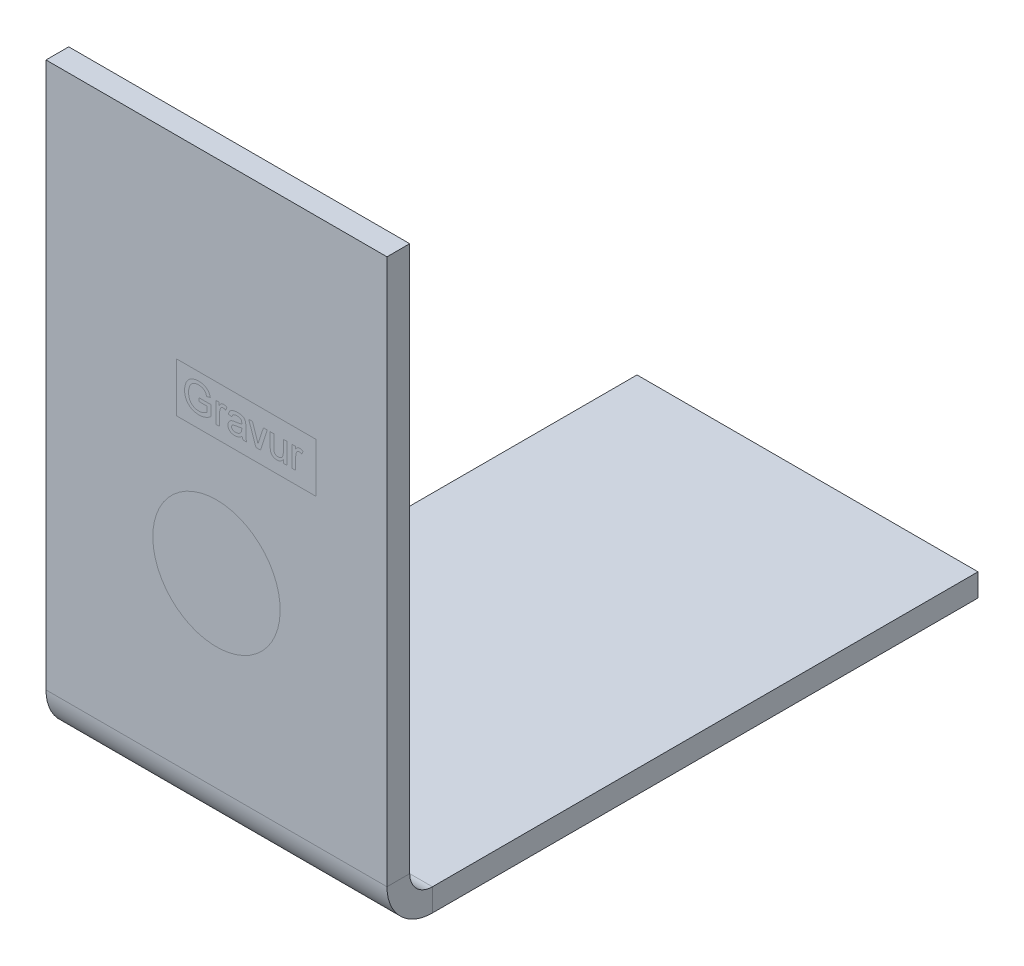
ISO-10303-21;
HEADER;
FILE_DESCRIPTION(('STEP AP214'),'2;1');
FILE_NAME('part.step','',(''),(''),'','','');
FILE_SCHEMA(('AUTOMOTIVE_DESIGN { 1 0 10303 214 1 1 1 1 }'));
ENDSEC;
DATA;
#1=APPLICATION_CONTEXT('core data for automotive mechanical design processes');
#2=APPLICATION_PROTOCOL_DEFINITION('international standard','automotive_design',2000,#1);
#3=PRODUCT_CONTEXT('',#1,'mechanical');
#4=PRODUCT('Part','Part','',(#3));
#5=PRODUCT_RELATED_PRODUCT_CATEGORY('part','',(#4));
#6=PRODUCT_DEFINITION_FORMATION('','',#4);
#7=PRODUCT_DEFINITION_CONTEXT('part definition',#1,'design');
#8=PRODUCT_DEFINITION('design','',#6,#7);
#9=PRODUCT_DEFINITION_SHAPE('','',#8);
#10=(LENGTH_UNIT() NAMED_UNIT(*) SI_UNIT(.MILLI.,.METRE.));
#11=(NAMED_UNIT(*) PLANE_ANGLE_UNIT() SI_UNIT($,.RADIAN.));
#12=(NAMED_UNIT(*) SI_UNIT($,.STERADIAN.) SOLID_ANGLE_UNIT());
#13=UNCERTAINTY_MEASURE_WITH_UNIT(LENGTH_MEASURE(1.E-05),#10,'distance_accuracy_value','');
#14=(GEOMETRIC_REPRESENTATION_CONTEXT(3) GLOBAL_UNCERTAINTY_ASSIGNED_CONTEXT((#13)) GLOBAL_UNIT_ASSIGNED_CONTEXT((#10,
#11,#12)) REPRESENTATION_CONTEXT('',''));
#15=CARTESIAN_POINT('',(0.,0.,0.));
#16=DIRECTION('',(0.,0.,1.));
#17=DIRECTION('',(1.,0.,0.));
#18=AXIS2_PLACEMENT_3D('',#15,#16,#17);
#19=CARTESIAN_POINT('',(30.,100.,4.));
#20=DIRECTION('',(0.,0.,-1.));
#21=DIRECTION('',(0.,1.,0.));
#22=AXIS2_PLACEMENT_3D('',#19,#20,#21);
#23=PLANE('',#22);
#24=CARTESIAN_POINT('',(0.,36.7603342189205,4.));
#25=DIRECTION('',(0.,0.,-1.));
#26=DIRECTION('',(0.,1.,0.));
#27=AXIS2_PLACEMENT_3D('',#24,#25,#26);
#28=CIRCLE('',#27,11.2079294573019);
#29=CARTESIAN_POINT('',(0.,47.9682636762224,4.));
#30=VERTEX_POINT('',#29);
#31=EDGE_CURVE('E13',#30,#30,#28,.F.);
#32=ORIENTED_EDGE('',*,*,#31,.T.);
#33=EDGE_LOOP('',(#32));
#34=FACE_BOUND('',#33,.T.);
#35=ADVANCED_FACE('F3687',(#34),#23,.F.);
#36=DIRECTION('',(0.,-1.,0.));
#37=VECTOR('',#36,1.);
#38=CARTESIAN_POINT('',(13.9384836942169,61.362234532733,4.));
#39=LINE('',#38,#37);
#40=CARTESIAN_POINT('',(13.9384836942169,61.362234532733,4.));
#41=VERTEX_POINT('',#40);
#42=CARTESIAN_POINT('',(13.9384836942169,59.4211287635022,4.));
#43=VERTEX_POINT('',#42);
#44=EDGE_CURVE('E4411',#41,#43,#39,.T.);
#45=ORIENTED_EDGE('',*,*,#44,.T.);
#46=DIRECTION('',(-1.,0.,0.));
#47=VECTOR('',#46,1.);
#48=CARTESIAN_POINT('',(13.9384836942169,59.4211287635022,4.));
#49=LINE('',#48,#47);
#50=CARTESIAN_POINT('',(13.2974580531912,59.4211287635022,4.));
#51=VERTEX_POINT('',#50);
#52=EDGE_CURVE('E4457',#43,#51,#49,.T.);
#53=ORIENTED_EDGE('',*,*,#52,.T.);
#54=DIRECTION('',(0.,1.,0.));
#55=VECTOR('',#54,1.);
#56=CARTESIAN_POINT('',(13.2974580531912,59.4211287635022,4.));
#57=LINE('',#56,#55);
#58=CARTESIAN_POINT('',(13.2974580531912,63.0749749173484,4.));
#59=VERTEX_POINT('',#58);
#60=EDGE_CURVE('E4455',#51,#59,#57,.T.);
#61=ORIENTED_EDGE('',*,*,#60,.T.);
#62=DIRECTION('',(1.,0.,0.));
#63=VECTOR('',#62,1.);
#64=CARTESIAN_POINT('',(13.2974580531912,63.0749749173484,4.));
#65=LINE('',#64,#63);
#66=CARTESIAN_POINT('',(13.8743811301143,63.0749749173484,4.));
#67=VERTEX_POINT('',#66);
#68=EDGE_CURVE('E4453',#59,#67,#65,.T.);
#69=ORIENTED_EDGE('',*,*,#68,.T.);
#70=DIRECTION('',(0.,-1.,0.));
#71=VECTOR('',#70,1.);
#72=CARTESIAN_POINT('',(13.8743811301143,63.0749749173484,4.));
#73=LINE('',#72,#71);
#74=CARTESIAN_POINT('',(13.8743811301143,62.5651592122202,4.));
#75=VERTEX_POINT('',#74);
#76=EDGE_CURVE('E4448',#67,#75,#73,.T.);
#77=ORIENTED_EDGE('',*,*,#76,.T.);
#78=CARTESIAN_POINT('',(13.8743811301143,62.5651592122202,4.));
#79=CARTESIAN_POINT('',(13.9066521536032,62.6190824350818,4.));
#80=CARTESIAN_POINT('',(13.9664385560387,62.7189824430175,4.));
#81=CARTESIAN_POINT('',(14.060732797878,62.8506250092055,4.));
#82=CARTESIAN_POINT('',(14.1504527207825,62.9537285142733,4.));
#83=CARTESIAN_POINT('',(14.2410235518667,63.0271938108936,4.));
#84=CARTESIAN_POINT('',(14.3316601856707,63.0780377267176,4.));
#85=CARTESIAN_POINT('',(14.4242107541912,63.1130410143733,4.));
#86=CARTESIAN_POINT('',(14.5210404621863,63.135276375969,4.));
#87=CARTESIAN_POINT('',(14.5870680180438,63.1377978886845,4.));
#88=CARTESIAN_POINT('',(14.6205750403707,63.1390774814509,4.));
#89=B_SPLINE_CURVE_WITH_KNOTS('',3,(#78,#79,#80,#81,#82,#83,#84,#85,#86,#87,#88),.UNSPECIFIED.,
.F.,.F.,(4,1,1,1,1,1,1,1,4),(0.,0.189667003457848,0.351383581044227,0.48842709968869,
0.600991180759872,0.701645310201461,0.800870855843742,0.898947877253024,1.),.UNSPECIFIED.);
#90=CARTESIAN_POINT('',(14.6205750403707,63.1390774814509,4.));
#91=VERTEX_POINT('',#90);
#92=EDGE_CURVE('E4441',#75,#91,#89,.T.);
#93=ORIENTED_EDGE('',*,*,#92,.T.);
#94=CARTESIAN_POINT('',(14.6205750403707,63.1390774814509,4.));
#95=CARTESIAN_POINT('',(14.6701666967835,63.1368642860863,4.));
#96=CARTESIAN_POINT('',(14.77068305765,63.1323784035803,4.));
#97=CARTESIAN_POINT('',(14.9212902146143,63.0979511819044,4.));
#98=CARTESIAN_POINT('',(15.0736792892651,63.0457547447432,4.));
#99=CARTESIAN_POINT('',(15.1707394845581,62.9942349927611,4.));
#100=CARTESIAN_POINT('',(15.2205349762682,62.9678034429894,4.));
#101=B_SPLINE_CURVE_WITH_KNOTS('',3,(#94,#95,#96,#97,#98,#99,#100),.UNSPECIFIED.,.F.,.F.,(4,1,1,
1,4),(0.,0.235779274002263,0.47789641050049,0.732141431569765,1.),.UNSPECIFIED.);
#102=CARTESIAN_POINT('',(15.2205349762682,62.9678034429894,4.));
#103=VERTEX_POINT('',#102);
#104=EDGE_CURVE('E4437',#91,#103,#101,.T.);
#105=ORIENTED_EDGE('',*,*,#104,.T.);
#106=DIRECTION('',(-0.339019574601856,-0.940779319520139,0.));
#107=VECTOR('',#106,1.);
#108=CARTESIAN_POINT('',(15.2205349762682,62.9678034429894,4.));
#109=LINE('',#108,#107);
#110=CARTESIAN_POINT('',(15.0202144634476,62.4119140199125,4.));
#111=VERTEX_POINT('',#110);
#112=EDGE_CURVE('E4432',#103,#111,#109,.T.);
#113=ORIENTED_EDGE('',*,*,#112,.T.);
#114=CARTESIAN_POINT('',(15.0202144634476,62.4119140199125,4.));
#115=CARTESIAN_POINT('',(14.9854366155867,62.4350372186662,4.));
#116=CARTESIAN_POINT('',(14.9183639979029,62.4796326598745,4.));
#117=CARTESIAN_POINT('',(14.8108161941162,62.5268640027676,4.));
#118=CARTESIAN_POINT('',(14.7033549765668,62.5570093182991,4.));
#119=CARTESIAN_POINT('',(14.6311121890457,62.5604566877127,4.));
#120=CARTESIAN_POINT('',(14.5955349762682,62.5621544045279,4.));
#121=B_SPLINE_CURVE_WITH_KNOTS('',3,(#114,#115,#116,#117,#118,#119,#120),.UNSPECIFIED.,.F.,.F.,
(4,1,1,1,4),(0.,0.273331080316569,0.527146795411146,0.767135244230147,1.),.UNSPECIFIED.);
#122=CARTESIAN_POINT('',(14.5955349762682,62.5621544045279,4.));
#123=VERTEX_POINT('',#122);
#124=EDGE_CURVE('E4425',#111,#123,#121,.T.);
#125=ORIENTED_EDGE('',*,*,#124,.T.);
#126=CARTESIAN_POINT('',(14.5955349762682,62.5621544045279,4.));
#127=CARTESIAN_POINT('',(14.5646741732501,62.5605866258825,4.));
#128=CARTESIAN_POINT('',(14.5037406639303,62.5574911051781,4.));
#129=CARTESIAN_POINT('',(14.414709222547,62.5334475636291,4.));
#130=CARTESIAN_POINT('',(14.3309461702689,62.4937100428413,4.));
#131=CARTESIAN_POINT('',(14.2525160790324,62.4395016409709,4.));
#132=CARTESIAN_POINT('',(14.1827607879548,62.3709818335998,4.));
#133=CARTESIAN_POINT('',(14.1215377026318,62.2908470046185,4.));
#134=CARTESIAN_POINT('',(14.0720635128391,62.197689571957,4.));
#135=CARTESIAN_POINT('',(14.049344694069,62.1295198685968,4.));
#136=CARTESIAN_POINT('',(14.037642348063,62.094406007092,4.));
#137=B_SPLINE_CURVE_WITH_KNOTS('',3,(#126,#127,#128,#129,#130,#131,#132,#133,#134,#135,#136),
.UNSPECIFIED.,.F.,.F.,(4,1,1,1,1,1,1,1,4),(0.,0.118293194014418,0.233565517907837,
0.351037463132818,0.472560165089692,0.597570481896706,0.724644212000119,0.858165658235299,1.),.UNSPECIFIED.);
#138=CARTESIAN_POINT('',(14.037642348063,62.094406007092,4.));
#139=VERTEX_POINT('',#138);
#140=EDGE_CURVE('E4418',#123,#139,#137,.T.);
#141=ORIENTED_EDGE('',*,*,#140,.T.);
#142=CARTESIAN_POINT('',(14.037642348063,62.094406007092,4.));
#143=CARTESIAN_POINT('',(14.02235952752,62.0375217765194,4.));
#144=CARTESIAN_POINT('',(13.9913309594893,61.9220302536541,4.));
#145=CARTESIAN_POINT('',(13.961538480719,61.7423215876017,4.));
#146=CARTESIAN_POINT('',(13.941395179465,61.5550045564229,4.));
#147=CARTESIAN_POINT('',(13.9394678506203,61.4273957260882,4.));
#148=CARTESIAN_POINT('',(13.9384836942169,61.362234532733,4.));
#149=B_SPLINE_CURVE_WITH_KNOTS('',3,(#142,#143,#144,#145,#146,#147,#148),.UNSPECIFIED.,.F.,.F.,
(4,1,1,1,4),(0.,0.238259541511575,0.483736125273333,0.736378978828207,1.),.UNSPECIFIED.);
#150=EDGE_CURVE('E4414',#139,#41,#149,.T.);
#151=ORIENTED_EDGE('',*,*,#150,.T.);
#152=EDGE_LOOP('',(#45,#53,#61,#69,#77,#93,#105,#113,#125,#141,#151));
#153=FACE_BOUND('',#152,.T.);
#154=DIRECTION('',(-0.308944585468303,-0.951080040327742,0.));
#155=VECTOR('',#154,1.);
#156=CARTESIAN_POINT('',(8.93848369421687,63.0749749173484,4.));
#157=LINE('',#156,#155);
#158=CARTESIAN_POINT('',(8.93848369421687,63.0749749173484,4.));
#159=VERTEX_POINT('',#158);
#160=CARTESIAN_POINT('',(7.75158465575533,59.4211287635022,4.));
#161=VERTEX_POINT('',#160);
#162=EDGE_CURVE('E4323',#159,#161,#157,.T.);
#163=ORIENTED_EDGE('',*,*,#162,.T.);
#164=DIRECTION('',(-1.,0.,0.));
#165=VECTOR('',#164,1.);
#166=CARTESIAN_POINT('',(7.75158465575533,59.4211287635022,4.));
#167=LINE('',#166,#165);
#168=CARTESIAN_POINT('',(6.93928497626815,59.4211287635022,4.));
#169=VERTEX_POINT('',#168);
#170=EDGE_CURVE('E4350',#161,#169,#167,.T.);
#171=ORIENTED_EDGE('',*,*,#170,.T.);
#172=DIRECTION('',(-0.328319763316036,0.944566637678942,0.));
#173=VECTOR('',#172,1.);
#174=CARTESIAN_POINT('',(6.93928497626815,59.4211287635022,4.));
#175=LINE('',#174,#173);
#176=CARTESIAN_POINT('',(5.6692529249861,63.0749749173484,4.));
#177=VERTEX_POINT('',#176);
#178=EDGE_CURVE('E4348',#169,#177,#175,.T.);
#179=ORIENTED_EDGE('',*,*,#178,.T.);
#180=DIRECTION('',(1.,0.,0.));
#181=VECTOR('',#180,1.);
#182=CARTESIAN_POINT('',(5.6692529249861,63.0749749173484,4.));
#183=LINE('',#182,#181);
#184=CARTESIAN_POINT('',(6.34733786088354,63.0749749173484,4.));
#185=VERTEX_POINT('',#184);
#186=EDGE_CURVE('E4346',#177,#185,#183,.T.);
#187=ORIENTED_EDGE('',*,*,#186,.T.);
#188=DIRECTION('',(0.31570660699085,-0.948856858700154,0.));
#189=VECTOR('',#188,1.);
#190=CARTESIAN_POINT('',(6.34733786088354,63.0749749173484,4.));
#191=LINE('',#190,#189);
#192=CARTESIAN_POINT('',(7.0755029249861,60.8864733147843,4.));
#193=VERTEX_POINT('',#192);
#194=EDGE_CURVE('E4341',#185,#193,#191,.T.);
#195=ORIENTED_EDGE('',*,*,#194,.T.);
#196=CARTESIAN_POINT('',(7.0755029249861,60.8864733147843,4.));
#197=CARTESIAN_POINT('',(7.11627561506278,60.7662707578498,4.));
#198=CARTESIAN_POINT('',(7.19883488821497,60.5228765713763,4.));
#199=CARTESIAN_POINT('',(7.2685716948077,60.2755017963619,4.));
#200=CARTESIAN_POINT('',(7.30386830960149,60.1502954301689,4.));
#201=B_SPLINE_CURVE_WITH_KNOTS('',3,(#196,#197,#198,#199,#200),.UNSPECIFIED.,.F.,.F.,(4,1,4),
(0.,0.493859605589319,1.),.UNSPECIFIED.);
#202=CARTESIAN_POINT('',(7.30386830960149,60.1502954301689,4.));
#203=VERTEX_POINT('',#202);
#204=EDGE_CURVE('E4334',#193,#203,#201,.T.);
#205=ORIENTED_EDGE('',*,*,#204,.T.);
#206=CARTESIAN_POINT('',(7.30386830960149,60.1502954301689,4.));
#207=CARTESIAN_POINT('',(7.31831901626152,60.2011147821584,4.));
#208=CARTESIAN_POINT('',(7.34865542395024,60.3077999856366,4.));
#209=CARTESIAN_POINT('',(7.40138883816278,60.4742367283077,4.));
#210=CARTESIAN_POINT('',(7.4611984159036,60.6553113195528,4.));
#211=CARTESIAN_POINT('',(7.50529844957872,60.7803806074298,4.));
#212=CARTESIAN_POINT('',(7.52822728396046,60.8454076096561,4.));
#213=B_SPLINE_CURVE_WITH_KNOTS('',3,(#206,#207,#208,#209,#210,#211,#212),.UNSPECIFIED.,.F.,.F.,
(4,1,1,1,4),(0.,0.216946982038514,0.455437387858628,0.716866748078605,1.),.UNSPECIFIED.);
#214=CARTESIAN_POINT('',(7.52822728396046,60.8454076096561,4.));
#215=VERTEX_POINT('',#214);
#216=EDGE_CURVE('E4330',#203,#215,#213,.T.);
#217=ORIENTED_EDGE('',*,*,#216,.T.);
#218=DIRECTION('',(0.311999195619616,0.950082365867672,0.));
#219=VECTOR('',#218,1.);
#220=CARTESIAN_POINT('',(7.52822728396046,60.8454076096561,4.));
#221=LINE('',#220,#219);
#222=CARTESIAN_POINT('',(8.26039875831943,63.0749749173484,4.));
#223=VERTEX_POINT('',#222);
#224=EDGE_CURVE('E4328',#215,#223,#221,.T.);
#225=ORIENTED_EDGE('',*,*,#224,.T.);
#226=DIRECTION('',(1.,0.,0.));
#227=VECTOR('',#226,1.);
#228=CARTESIAN_POINT('',(8.26039875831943,63.0749749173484,4.));
#229=LINE('',#228,#227);
#230=EDGE_CURVE('E4326',#223,#159,#229,.T.);
#231=ORIENTED_EDGE('',*,*,#230,.T.);
#232=EDGE_LOOP('',(#163,#171,#179,#187,#195,#205,#217,#225,#231));
#233=FACE_BOUND('',#232,.T.);
#234=DIRECTION('',(0.,-1.,0.));
#235=VECTOR('',#234,1.);
#236=CARTESIAN_POINT('',(0.541047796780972,61.362234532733,4.));
#237=LINE('',#236,#235);
#238=CARTESIAN_POINT('',(0.541047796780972,61.362234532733,4.));
#239=VERTEX_POINT('',#238);
#240=CARTESIAN_POINT('',(0.541047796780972,59.4211287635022,4.));
#241=VERTEX_POINT('',#240);
#242=EDGE_CURVE('E4132',#239,#241,#237,.T.);
#243=ORIENTED_EDGE('',*,*,#242,.T.);
#244=DIRECTION('',(-1.,0.,0.));
#245=VECTOR('',#244,1.);
#246=CARTESIAN_POINT('',(0.541047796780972,59.4211287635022,4.));
#247=LINE('',#246,#245);
#248=CARTESIAN_POINT('',(-0.0999778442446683,59.4211287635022,4.));
#249=VERTEX_POINT('',#248);
#250=EDGE_CURVE('E4178',#241,#249,#247,.T.);
#251=ORIENTED_EDGE('',*,*,#250,.T.);
#252=DIRECTION('',(0.,1.,0.));
#253=VECTOR('',#252,1.);
#254=CARTESIAN_POINT('',(-0.0999778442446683,59.4211287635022,4.));
#255=LINE('',#254,#253);
#256=CARTESIAN_POINT('',(-0.0999778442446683,63.0749749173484,4.));
#257=VERTEX_POINT('',#256);
#258=EDGE_CURVE('E4176',#249,#257,#255,.T.);
#259=ORIENTED_EDGE('',*,*,#258,.T.);
#260=DIRECTION('',(1.,0.,0.));
#261=VECTOR('',#260,1.);
#262=CARTESIAN_POINT('',(-0.0999778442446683,63.0749749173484,4.));
#263=LINE('',#262,#261);
#264=CARTESIAN_POINT('',(0.476945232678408,63.0749749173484,4.));
#265=VERTEX_POINT('',#264);
#266=EDGE_CURVE('E4174',#257,#265,#263,.T.);
#267=ORIENTED_EDGE('',*,*,#266,.T.);
#268=DIRECTION('',(0.,-1.,0.));
#269=VECTOR('',#268,1.);
#270=CARTESIAN_POINT('',(0.476945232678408,63.0749749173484,4.));
#271=LINE('',#270,#269);
#272=CARTESIAN_POINT('',(0.476945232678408,62.5651592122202,4.));
#273=VERTEX_POINT('',#272);
#274=EDGE_CURVE('E4169',#265,#273,#271,.T.);
#275=ORIENTED_EDGE('',*,*,#274,.T.);
#276=CARTESIAN_POINT('',(0.476945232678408,62.5651592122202,4.));
#277=CARTESIAN_POINT('',(0.509216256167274,62.6190824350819,4.));
#278=CARTESIAN_POINT('',(0.569002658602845,62.7189824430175,4.));
#279=CARTESIAN_POINT('',(0.663296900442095,62.8506250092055,4.));
#280=CARTESIAN_POINT('',(0.753016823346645,62.9537285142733,4.));
#281=CARTESIAN_POINT('',(0.843587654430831,63.0271938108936,4.));
#282=CARTESIAN_POINT('',(0.934224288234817,63.0780377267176,4.));
#283=CARTESIAN_POINT('',(1.02677485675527,63.1130410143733,4.));
#284=CARTESIAN_POINT('',(1.12360456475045,63.1352763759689,4.));
#285=CARTESIAN_POINT('',(1.18963212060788,63.1377978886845,4.));
#286=CARTESIAN_POINT('',(1.22313914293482,63.1390774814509,4.));
#287=B_SPLINE_CURVE_WITH_KNOTS('',3,(#276,#277,#278,#279,#280,#281,#282,#283,#284,#285,#286),
.UNSPECIFIED.,.F.,.F.,(4,1,1,1,1,1,1,1,4),(0.,0.189667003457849,0.351383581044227,
0.488427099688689,0.600991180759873,0.701645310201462,0.800870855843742,0.898947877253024,1.),.UNSPECIFIED.);
#288=CARTESIAN_POINT('',(1.22313914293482,63.1390774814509,4.));
#289=VERTEX_POINT('',#288);
#290=EDGE_CURVE('E4162',#273,#289,#287,.T.);
#291=ORIENTED_EDGE('',*,*,#290,.T.);
#292=CARTESIAN_POINT('',(1.22313914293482,63.1390774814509,4.));
#293=CARTESIAN_POINT('',(1.2727307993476,63.1368642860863,4.));
#294=CARTESIAN_POINT('',(1.37324716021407,63.1323784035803,4.));
#295=CARTESIAN_POINT('',(1.52385431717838,63.0979511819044,4.));
#296=CARTESIAN_POINT('',(1.67624339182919,63.0457547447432,4.));
#297=CARTESIAN_POINT('',(1.77330358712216,62.9942349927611,4.));
#298=CARTESIAN_POINT('',(1.82309907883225,62.9678034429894,4.));
#299=B_SPLINE_CURVE_WITH_KNOTS('',3,(#292,#293,#294,#295,#296,#297,#298),.UNSPECIFIED.,.F.,.F.,
(4,1,1,1,4),(0.,0.235779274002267,0.47789641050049,0.732141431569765,1.),.UNSPECIFIED.);
#300=CARTESIAN_POINT('',(1.82309907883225,62.9678034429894,4.));
#301=VERTEX_POINT('',#300);
#302=EDGE_CURVE('E4158',#289,#301,#299,.T.);
#303=ORIENTED_EDGE('',*,*,#302,.T.);
#304=DIRECTION('',(-0.339019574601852,-0.940779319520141,0.));
#305=VECTOR('',#304,1.);
#306=CARTESIAN_POINT('',(1.82309907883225,62.9678034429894,4.));
#307=LINE('',#306,#305);
#308=CARTESIAN_POINT('',(1.62277856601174,62.4119140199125,4.));
#309=VERTEX_POINT('',#308);
#310=EDGE_CURVE('E4153',#301,#309,#307,.T.);
#311=ORIENTED_EDGE('',*,*,#310,.T.);
#312=CARTESIAN_POINT('',(1.62277856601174,62.4119140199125,4.));
#313=CARTESIAN_POINT('',(1.58800071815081,62.4350372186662,4.));
#314=CARTESIAN_POINT('',(1.52092810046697,62.4796326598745,4.));
#315=CARTESIAN_POINT('',(1.41338029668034,62.5268640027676,4.));
#316=CARTESIAN_POINT('',(1.30591907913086,62.5570093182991,4.));
#317=CARTESIAN_POINT('',(1.23367629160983,62.5604566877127,4.));
#318=CARTESIAN_POINT('',(1.19809907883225,62.5621544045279,4.));
#319=B_SPLINE_CURVE_WITH_KNOTS('',3,(#312,#313,#314,#315,#316,#317,#318),.UNSPECIFIED.,.F.,.F.,
(4,1,1,1,4),(0.,0.273331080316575,0.52714679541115,0.767135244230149,1.),.UNSPECIFIED.);
#320=CARTESIAN_POINT('',(1.19809907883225,62.5621544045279,4.));
#321=VERTEX_POINT('',#320);
#322=EDGE_CURVE('E4146',#309,#321,#319,.T.);
#323=ORIENTED_EDGE('',*,*,#322,.T.);
#324=CARTESIAN_POINT('',(1.19809907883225,62.5621544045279,4.));
#325=CARTESIAN_POINT('',(1.16723827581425,62.5605866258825,4.));
#326=CARTESIAN_POINT('',(1.10630476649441,62.5574911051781,4.));
#327=CARTESIAN_POINT('',(1.01727332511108,62.5334475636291,4.));
#328=CARTESIAN_POINT('',(0.933510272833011,62.4937100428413,4.));
#329=CARTESIAN_POINT('',(0.855080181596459,62.4395016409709,4.));
#330=CARTESIAN_POINT('',(0.785324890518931,62.3709818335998,4.));
#331=CARTESIAN_POINT('',(0.724101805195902,62.2908470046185,4.));
#332=CARTESIAN_POINT('',(0.674627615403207,62.197689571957,4.));
#333=CARTESIAN_POINT('',(0.651908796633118,62.1295198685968,4.));
#334=CARTESIAN_POINT('',(0.640206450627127,62.094406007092,4.));
#335=B_SPLINE_CURVE_WITH_KNOTS('',3,(#324,#325,#326,#327,#328,#329,#330,#331,#332,#333,#334),
.UNSPECIFIED.,.F.,.F.,(4,1,1,1,1,1,1,1,4),(0.,0.118293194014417,0.233565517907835,
0.351037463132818,0.47256016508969,0.597570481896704,0.724644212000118,0.858165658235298,1.),.UNSPECIFIED.);
#336=CARTESIAN_POINT('',(0.640206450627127,62.094406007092,4.));
#337=VERTEX_POINT('',#336);
#338=EDGE_CURVE('E4139',#321,#337,#335,.T.);
#339=ORIENTED_EDGE('',*,*,#338,.T.);
#340=CARTESIAN_POINT('',(0.640206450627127,62.094406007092,4.));
#341=CARTESIAN_POINT('',(0.624923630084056,62.0375217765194,4.));
#342=CARTESIAN_POINT('',(0.593895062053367,61.9220302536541,4.));
#343=CARTESIAN_POINT('',(0.564102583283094,61.7423215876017,4.));
#344=CARTESIAN_POINT('',(0.543959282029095,61.5550045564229,4.));
#345=CARTESIAN_POINT('',(0.542031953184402,61.4273957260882,4.));
#346=CARTESIAN_POINT('',(0.541047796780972,61.362234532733,4.));
#347=B_SPLINE_CURVE_WITH_KNOTS('',3,(#340,#341,#342,#343,#344,#345,#346),.UNSPECIFIED.,.F.,.F.,
(4,1,1,1,4),(0.,0.238259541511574,0.483736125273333,0.736378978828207,1.),.UNSPECIFIED.);
#348=EDGE_CURVE('E4135',#337,#239,#347,.T.);
#349=ORIENTED_EDGE('',*,*,#348,.T.);
#350=EDGE_LOOP('',(#243,#251,#259,#267,#275,#291,#303,#311,#323,#339,#349));
#351=FACE_BOUND('',#350,.T.);
#352=DIRECTION('',(0.,1.,0.));
#353=VECTOR('',#352,1.);
#354=CARTESIAN_POINT('',(-1.70254194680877,60.4607922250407,4.));
#355=LINE('',#354,#353);
#356=CARTESIAN_POINT('',(-1.70254194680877,60.4607922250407,4.));
#357=VERTEX_POINT('',#356);
#358=CARTESIAN_POINT('',(-1.70254194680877,61.4083082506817,4.));
#359=VERTEX_POINT('',#358);
#360=EDGE_CURVE('E4021',#357,#359,#355,.T.);
#361=ORIENTED_EDGE('',*,*,#360,.T.);
#362=DIRECTION('',(-1.,0.,0.));
#363=VECTOR('',#362,1.);
#364=CARTESIAN_POINT('',(-1.70254194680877,61.4083082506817,4.));
#365=LINE('',#364,#363);
#366=CARTESIAN_POINT('',(-3.04869579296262,61.4083082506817,4.));
#367=VERTEX_POINT('',#366);
#368=EDGE_CURVE('E4130',#359,#367,#365,.T.);
#369=ORIENTED_EDGE('',*,*,#368,.T.);
#370=DIRECTION('',(0.,1.,0.));
#371=VECTOR('',#370,1.);
#372=CARTESIAN_POINT('',(-3.04869579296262,61.4083082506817,4.));
#373=LINE('',#372,#371);
#374=CARTESIAN_POINT('',(-3.04869579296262,61.9852313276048,4.));
#375=VERTEX_POINT('',#374);
#376=EDGE_CURVE('E4128',#367,#375,#373,.T.);
#377=ORIENTED_EDGE('',*,*,#376,.T.);
#378=DIRECTION('',(1.,0.,0.));
#379=VECTOR('',#378,1.);
#380=CARTESIAN_POINT('',(-3.04869579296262,61.9852313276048,4.));
#381=LINE('',#380,#379);
#382=CARTESIAN_POINT('',(-0.997413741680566,61.9852313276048,4.));
#383=VERTEX_POINT('',#382);
#384=EDGE_CURVE('E4126',#375,#383,#381,.T.);
#385=ORIENTED_EDGE('',*,*,#384,.T.);
#386=DIRECTION('',(0.,-1.,0.));
#387=VECTOR('',#386,1.);
#388=CARTESIAN_POINT('',(-0.997413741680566,61.9852313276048,4.));
#389=LINE('',#388,#387);
#390=CARTESIAN_POINT('',(-0.997413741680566,60.1352713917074,4.));
#391=VERTEX_POINT('',#390);
#392=EDGE_CURVE('E4121',#383,#391,#389,.T.);
#393=ORIENTED_EDGE('',*,*,#392,.T.);
#394=CARTESIAN_POINT('',(-0.997413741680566,60.1352713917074,4.));
#395=CARTESIAN_POINT('',(-1.07834721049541,60.0736301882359,4.));
#396=CARTESIAN_POINT('',(-1.23763431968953,59.9523126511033,4.));
#397=CARTESIAN_POINT('',(-1.48744367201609,59.794097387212,4.));
#398=CARTESIAN_POINT('',(-1.74135032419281,59.6599120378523,4.));
#399=CARTESIAN_POINT('',(-1.99865256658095,59.5491329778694,4.));
#400=CARTESIAN_POINT('',(-2.26023478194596,59.4636336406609,4.));
#401=CARTESIAN_POINT('',(-2.52496763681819,59.4024352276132,4.));
#402=CARTESIAN_POINT('',(-2.79313942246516,59.3636728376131,4.));
#403=CARTESIAN_POINT('',(-2.97344674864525,59.3592437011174,4.));
#404=CARTESIAN_POINT('',(-3.06371983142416,59.3570261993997,4.));
#405=B_SPLINE_CURVE_WITH_KNOTS('',3,(#394,#395,#396,#397,#398,#399,#400,#401,#402,#403,#404),
.UNSPECIFIED.,.F.,.F.,(4,1,1,1,1,1,1,1,4),(0.,0.135541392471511,0.266762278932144,
0.393553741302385,0.51794573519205,0.639663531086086,0.759797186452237,0.879739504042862,1.),.UNSPECIFIED.);
#406=CARTESIAN_POINT('',(-3.06371983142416,59.3570261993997,4.));
#407=VERTEX_POINT('',#406);
#408=EDGE_CURVE('E4114',#391,#407,#405,.T.);
#409=ORIENTED_EDGE('',*,*,#408,.T.);
#410=CARTESIAN_POINT('',(-3.06371983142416,59.3570261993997,4.));
#411=CARTESIAN_POINT('',(-3.1241840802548,59.3579543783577,4.));
#412=CARTESIAN_POINT('',(-3.24429841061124,59.3597982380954,4.));
#413=CARTESIAN_POINT('',(-3.42213377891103,59.3755725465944,4.));
#414=CARTESIAN_POINT('',(-3.59581668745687,59.3990109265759,4.));
#415=CARTESIAN_POINT('',(-3.76501769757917,59.4334757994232,4.));
#416=CARTESIAN_POINT('',(-3.93033415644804,59.4773533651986,4.));
#417=CARTESIAN_POINT('',(-4.09144764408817,59.5315781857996,4.));
#418=CARTESIAN_POINT('',(-4.2484256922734,59.594854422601,4.));
#419=CARTESIAN_POINT('',(-4.40039326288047,59.6673978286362,4.));
#420=CARTESIAN_POINT('',(-4.5450661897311,59.7505139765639,4.));
#421=CARTESIAN_POINT('',(-4.68204638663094,59.8416442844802,4.));
#422=CARTESIAN_POINT('',(-4.8096058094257,59.9421616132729,4.));
#423=CARTESIAN_POINT('',(-4.92794079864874,60.0512437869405,4.));
#424=CARTESIAN_POINT('',(-5.0366234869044,60.1695397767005,4.));
#425=CARTESIAN_POINT('',(-5.13726414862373,60.2954773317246,4.));
#426=CARTESIAN_POINT('',(-5.22716327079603,60.4313641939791,4.));
#427=CARTESIAN_POINT('',(-5.30830597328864,60.5747008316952,4.));
#428=CARTESIAN_POINT('',(-5.3799552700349,60.7244025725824,4.));
#429=CARTESIAN_POINT('',(-5.44251489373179,60.8791918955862,4.));
#430=CARTESIAN_POINT('',(-5.49422634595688,61.0386974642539,4.));
#431=CARTESIAN_POINT('',(-5.53735438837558,61.2022136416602,4.));
#432=CARTESIAN_POINT('',(-5.57165212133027,61.3696787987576,4.));
#433=CARTESIAN_POINT('',(-5.59560802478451,61.5416177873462,4.));
#434=CARTESIAN_POINT('',(-5.60970963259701,61.7178991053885,4.));
#435=CARTESIAN_POINT('',(-5.61176204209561,61.8369688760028,4.));
#436=CARTESIAN_POINT('',(-5.61279835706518,61.8970903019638,4.));
#437=B_SPLINE_CURVE_WITH_KNOTS('',3,(#410,#411,#412,#413,#414,#415,#416,#417,#418,#419,#420,
#421,#422,#423,#424,#425,#426,#427,#428,#429,#430,#431,#432,#433,#434,#435,#436),.UNSPECIFIED.,
.F.,.F.,(4,1,1,1,1,1,1,1,1,1,1,1,1,1,1,1,1,1,1,1,1,1,1,1,4),(0.,0.0446987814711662,
0.088795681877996,0.131911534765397,0.174224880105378,0.216380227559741,0.258300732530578,
0.299832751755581,0.341458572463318,0.382702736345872,0.423098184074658,0.463001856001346,
0.502657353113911,0.541964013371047,0.581674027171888,0.621727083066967,0.662297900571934,
0.7033717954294,0.744353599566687,0.785650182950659,0.827265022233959,0.869336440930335,
0.911963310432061,0.955547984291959,1.),.UNSPECIFIED.);
#438=CARTESIAN_POINT('',(-5.61279835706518,61.8970903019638,4.));
#439=VERTEX_POINT('',#438);
#440=EDGE_CURVE('E4107',#407,#439,#437,.T.);
#441=ORIENTED_EDGE('',*,*,#440,.T.);
#442=CARTESIAN_POINT('',(-5.61279835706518,61.8970903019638,4.));
#443=CARTESIAN_POINT('',(-5.61175919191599,61.956877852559,4.));
#444=CARTESIAN_POINT('',(-5.60969544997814,62.0756136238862,4.));
#445=CARTESIAN_POINT('',(-5.595473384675,62.2525476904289,4.));
#446=CARTESIAN_POINT('',(-5.57142970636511,62.4263838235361,4.));
#447=CARTESIAN_POINT('',(-5.53823644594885,62.5972214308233,4.));
#448=CARTESIAN_POINT('',(-5.49634662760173,62.7649123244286,4.));
#449=CARTESIAN_POINT('',(-5.44416101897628,62.9294889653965,4.));
#450=CARTESIAN_POINT('',(-5.38172534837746,63.0908005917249,4.));
#451=CARTESIAN_POINT('',(-5.3110127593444,63.2485063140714,4.));
#452=CARTESIAN_POINT('',(-5.23225620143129,63.4003496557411,4.));
#453=CARTESIAN_POINT('',(-5.14181188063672,63.5414779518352,4.));
#454=CARTESIAN_POINT('',(-5.04672115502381,63.6751886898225,4.));
#455=CARTESIAN_POINT('',(-4.93913876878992,63.7956689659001,4.));
#456=CARTESIAN_POINT('',(-4.82655229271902,63.9091393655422,4.));
#457=CARTESIAN_POINT('',(-4.70345295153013,64.010130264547,4.));
#458=CARTESIAN_POINT('',(-4.57294353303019,64.1016817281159,4.));
#459=CARTESIAN_POINT('',(-4.43445958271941,64.1828097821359,4.));
#460=CARTESIAN_POINT('',(-4.28881571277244,64.2536107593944,4.));
#461=CARTESIAN_POINT('',(-4.13774991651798,64.315965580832,4.));
#462=CARTESIAN_POINT('',(-3.98091934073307,64.3677084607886,4.));
#463=CARTESIAN_POINT('',(-3.81922288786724,64.4113629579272,4.));
#464=CARTESIAN_POINT('',(-3.65176458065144,64.4437989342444,4.));
#465=CARTESIAN_POINT('',(-3.47897605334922,64.4681986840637,4.));
#466=CARTESIAN_POINT('',(-3.30066207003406,64.4821350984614,4.));
#467=CARTESIAN_POINT('',(-3.17992887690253,64.4841906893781,4.));
#468=CARTESIAN_POINT('',(-3.1188079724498,64.4852313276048,4.));
#469=B_SPLINE_CURVE_WITH_KNOTS('',3,(#442,#443,#444,#445,#446,#447,#448,#449,#450,#451,#452,
#453,#454,#455,#456,#457,#458,#459,#460,#461,#462,#463,#464,#465,#466,#467,#468),.UNSPECIFIED.,
.F.,.F.,(4,1,1,1,1,1,1,1,1,1,1,1,1,1,1,1,1,1,1,1,1,1,1,1,4),(0.,0.0441658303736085,
0.087711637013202,0.131033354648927,0.173744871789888,0.216216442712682,0.258650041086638,
0.301201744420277,0.343924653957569,0.386289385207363,0.427414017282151,0.467670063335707,
0.507345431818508,0.546586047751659,0.585649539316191,0.624787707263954,0.664254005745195,
0.704074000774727,0.744333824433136,0.784890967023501,0.825991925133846,0.867977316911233,
0.910810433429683,0.95484798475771,1.),.UNSPECIFIED.);
#470=CARTESIAN_POINT('',(-3.1188079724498,64.4852313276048,4.));
#471=VERTEX_POINT('',#470);
#472=EDGE_CURVE('E4100',#439,#471,#469,.T.);
#473=ORIENTED_EDGE('',*,*,#472,.T.);
#474=CARTESIAN_POINT('',(-3.1188079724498,64.4852313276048,4.));
#475=CARTESIAN_POINT('',(-3.03057412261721,64.4831085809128,4.));
#476=CARTESIAN_POINT('',(-2.85817681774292,64.4789610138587,4.));
#477=CARTESIAN_POINT('',(-2.60577588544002,64.4467033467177,4.));
#478=CARTESIAN_POINT('',(-2.36706458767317,64.3915059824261,4.));
#479=CARTESIAN_POINT('',(-2.17788786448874,64.3280901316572,4.));
#480=CARTESIAN_POINT('',(-2.03580104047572,64.2662904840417,4.));
#481=CARTESIAN_POINT('',(-1.93536637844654,64.2163439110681,4.));
#482=CARTESIAN_POINT('',(-1.84095970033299,64.1618029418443,4.));
#483=CARTESIAN_POINT('',(-1.75149430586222,64.1044399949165,4.));
#484=CARTESIAN_POINT('',(-1.66896793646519,64.0404909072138,4.));
#485=CARTESIAN_POINT('',(-1.59229619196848,63.9729626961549,4.));
#486=CARTESIAN_POINT('',(-1.52127730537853,63.9010457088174,4.));
#487=CARTESIAN_POINT('',(-1.433842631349,63.7984063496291,4.));
#488=CARTESIAN_POINT('',(-1.33382109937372,63.655830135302,4.));
#489=CARTESIAN_POINT('',(-1.23346243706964,63.4622198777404,4.));
#490=CARTESIAN_POINT('',(-1.14556053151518,63.2463968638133,4.));
#491=CARTESIAN_POINT('',(-1.10205472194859,63.0918403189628,4.));
#492=CARTESIAN_POINT('',(-1.07954515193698,63.0118739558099,4.));
#493=B_SPLINE_CURVE_WITH_KNOTS('',3,(#474,#475,#476,#477,#478,#479,#480,#481,#482,#483,#484,
#485,#486,#487,#488,#489,#490,#491,#492),.UNSPECIFIED.,.F.,.F.,(4,1,1,1,1,1,1,1,1,1,1,1,1,1,1,1,
4),(0.,0.0962417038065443,0.188043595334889,0.277016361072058,0.363173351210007,
0.405261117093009,0.445983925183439,0.485469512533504,0.52416260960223,0.561827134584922,
0.599244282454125,0.635560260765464,0.671985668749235,0.7462558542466,0.824952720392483,
0.909431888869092,1.),.UNSPECIFIED.);
#494=CARTESIAN_POINT('',(-1.07954515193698,63.0118739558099,4.));
#495=VERTEX_POINT('',#494);
#496=EDGE_CURVE('E4096',#471,#495,#493,.T.);
#497=ORIENTED_EDGE('',*,*,#496,.T.);
#498=DIRECTION('',(-0.969787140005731,-0.243952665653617,0.));
#499=VECTOR('',#498,1.);
#500=CARTESIAN_POINT('',(-1.07954515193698,63.0118739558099,4.));
#501=LINE('',#500,#499);
#502=CARTESIAN_POINT('',(-1.72457720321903,62.8496143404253,4.));
#503=VERTEX_POINT('',#502);
#504=EDGE_CURVE('E4091',#495,#503,#501,.T.);
#505=ORIENTED_EDGE('',*,*,#504,.T.);
#506=CARTESIAN_POINT('',(-1.72457720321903,62.8496143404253,4.));
#507=CARTESIAN_POINT('',(-1.74319444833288,62.9089521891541,4.));
#508=CARTESIAN_POINT('',(-1.7788506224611,63.0225973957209,4.));
#509=CARTESIAN_POINT('',(-1.84165504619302,63.1814335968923,4.));
#510=CARTESIAN_POINT('',(-1.91481691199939,63.3185873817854,4.));
#511=CARTESIAN_POINT('',(-1.99304497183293,63.4393133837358,4.));
#512=CARTESIAN_POINT('',(-2.08624179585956,63.5431666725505,4.));
#513=CARTESIAN_POINT('',(-2.19444697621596,63.6351878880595,4.));
#514=CARTESIAN_POINT('',(-2.32090044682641,63.7151052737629,4.));
#515=CARTESIAN_POINT('',(-2.46281763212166,63.7835302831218,4.));
#516=CARTESIAN_POINT('',(-2.61710653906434,63.8394050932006,4.));
#517=CARTESIAN_POINT('',(-2.78132139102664,63.8792225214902,4.));
#518=CARTESIAN_POINT('',(-2.95379021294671,63.9039857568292,4.));
#519=CARTESIAN_POINT('',(-3.07164739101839,63.9068471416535,4.));
#520=CARTESIAN_POINT('',(-3.13182880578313,63.9083082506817,4.));
#521=B_SPLINE_CURVE_WITH_KNOTS('',3,(#506,#507,#508,#509,#510,#511,#512,#513,#514,#515,#516,
#517,#518,#519,#520),.UNSPECIFIED.,.F.,.F.,(4,1,1,1,1,1,1,1,1,1,1,1,4),(0.,0.0970736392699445,
0.185917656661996,0.266117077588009,0.339402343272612,0.409906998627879,0.483112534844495,
0.560458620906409,0.642739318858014,0.728631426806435,0.816102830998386,0.906096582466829,1.),.UNSPECIFIED.);
#522=CARTESIAN_POINT('',(-3.13182880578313,63.9083082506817,4.));
#523=VERTEX_POINT('',#522);
#524=EDGE_CURVE('E4084',#503,#523,#521,.T.);
#525=ORIENTED_EDGE('',*,*,#524,.T.);
#526=CARTESIAN_POINT('',(-3.13182880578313,63.9083082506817,4.));
#527=CARTESIAN_POINT('',(-3.20301529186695,63.9065137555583,4.));
#528=CARTESIAN_POINT('',(-3.34084106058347,63.9030393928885,4.));
#529=CARTESIAN_POINT('',(-3.54056995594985,63.8781328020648,4.));
#530=CARTESIAN_POINT('',(-3.72539875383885,63.8356440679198,4.));
#531=CARTESIAN_POINT('',(-3.8947079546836,63.7751012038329,4.));
#532=CARTESIAN_POINT('',(-4.04778647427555,63.700681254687,4.));
#533=CARTESIAN_POINT('',(-4.1868245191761,63.616528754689,4.));
#534=CARTESIAN_POINT('',(-4.30946504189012,63.5201889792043,4.));
#535=CARTESIAN_POINT('',(-4.41617421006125,63.4128907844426,4.));
#536=CARTESIAN_POINT('',(-4.50897547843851,63.2981077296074,4.));
#537=CARTESIAN_POINT('',(-4.59172886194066,63.1784632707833,4.));
#538=CARTESIAN_POINT('',(-4.6636936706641,63.0529921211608,4.));
#539=CARTESIAN_POINT('',(-4.70213124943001,62.964849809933,4.));
#540=CARTESIAN_POINT('',(-4.7213720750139,62.9207281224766,4.));
#541=B_SPLINE_CURVE_WITH_KNOTS('',3,(#526,#527,#528,#529,#530,#531,#532,#533,#534,#535,#536,
#537,#538,#539,#540),.UNSPECIFIED.,.F.,.F.,(4,1,1,1,1,1,1,1,1,1,1,1,4),(0.,0.106840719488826,
0.206856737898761,0.301553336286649,0.390955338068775,0.476129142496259,0.556665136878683,
0.634464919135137,0.709590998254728,0.783321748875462,0.855746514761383,0.927790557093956,1.),.UNSPECIFIED.);
#542=CARTESIAN_POINT('',(-4.7213720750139,62.9207281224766,4.));
#543=VERTEX_POINT('',#542);
#544=EDGE_CURVE('E4077',#523,#543,#541,.T.);
#545=ORIENTED_EDGE('',*,*,#544,.T.);
#546=CARTESIAN_POINT('',(-4.7213720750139,62.9207281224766,4.));
#547=CARTESIAN_POINT('',(-4.75010418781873,62.8431258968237,4.));
#548=CARTESIAN_POINT('',(-4.807936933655,62.6869261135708,4.));
#549=CARTESIAN_POINT('',(-4.8644338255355,62.440750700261,4.));
#550=CARTESIAN_POINT('',(-4.90090332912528,62.1853167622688,4.));
#551=CARTESIAN_POINT('',(-4.90539192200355,62.0114034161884,4.));
#552=CARTESIAN_POINT('',(-4.90767015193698,61.9231319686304,4.));
#553=B_SPLINE_CURVE_WITH_KNOTS('',3,(#546,#547,#548,#549,#550,#551,#552),.UNSPECIFIED.,.F.,.F.,
(4,1,1,1,4),(0.,0.242983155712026,0.48908283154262,0.740678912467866,1.),.UNSPECIFIED.);
#554=CARTESIAN_POINT('',(-4.90767015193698,61.9231319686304,4.));
#555=VERTEX_POINT('',#554);
#556=EDGE_CURVE('E4070',#543,#555,#553,.T.);
#557=ORIENTED_EDGE('',*,*,#556,.T.);
#558=CARTESIAN_POINT('',(-4.90767015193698,61.9231319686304,4.));
#559=CARTESIAN_POINT('',(-4.90732489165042,61.8690193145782,4.));
#560=CARTESIAN_POINT('',(-4.90664851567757,61.7630108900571,4.));
#561=CARTESIAN_POINT('',(-4.89452558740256,61.607360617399,4.));
#562=CARTESIAN_POINT('',(-4.87867447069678,61.458047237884,4.));
#563=CARTESIAN_POINT('',(-4.85294894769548,61.3158029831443,4.));
#564=CARTESIAN_POINT('',(-4.82236365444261,61.1802039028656,4.));
#565=CARTESIAN_POINT('',(-4.78442713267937,61.0511758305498,4.));
#566=CARTESIAN_POINT('',(-4.73805542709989,60.9293627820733,4.));
#567=CARTESIAN_POINT('',(-4.68626108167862,60.8135719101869,4.));
#568=CARTESIAN_POINT('',(-4.6269994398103,60.7050540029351,4.));
#569=CARTESIAN_POINT('',(-4.56100516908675,60.6039246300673,4.));
#570=CARTESIAN_POINT('',(-4.48852321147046,60.5102377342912,4.));
#571=CARTESIAN_POINT('',(-4.40980073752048,60.4238899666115,4.));
#572=CARTESIAN_POINT('',(-4.32600551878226,60.3431468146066,4.));
#573=CARTESIAN_POINT('',(-4.23451324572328,60.2710895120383,4.));
#574=CARTESIAN_POINT('',(-4.13635274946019,60.2066715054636,4.));
#575=CARTESIAN_POINT('',(-3.99863755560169,60.129957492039,4.));
#576=CARTESIAN_POINT('',(-3.81705582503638,60.0525138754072,4.));
#577=CARTESIAN_POINT('',(-3.59197268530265,59.9834187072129,4.));
#578=CARTESIAN_POINT('',(-3.3593464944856,59.9423813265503,4.));
#579=CARTESIAN_POINT('',(-3.20209932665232,59.9367756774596,4.));
#580=CARTESIAN_POINT('',(-3.12281438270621,59.9339492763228,4.));
#581=B_SPLINE_CURVE_WITH_KNOTS('',3,(#558,#559,#560,#561,#562,#563,#564,#565,#566,#567,#568,
#569,#570,#571,#572,#573,#574,#575,#576,#577,#578,#579,#580),.UNSPECIFIED.,.F.,.F.,(4,1,1,1,1,1,
1,1,1,1,1,1,1,1,1,1,1,1,1,1,4),(0.,0.0535380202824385,0.104882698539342,0.154435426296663,
0.202077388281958,0.24784571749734,0.291964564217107,0.335046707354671,0.376749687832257,
0.417413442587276,0.457280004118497,0.496142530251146,0.534505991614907,0.572835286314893,
0.611177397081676,0.649576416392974,0.688923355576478,0.767063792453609,0.844414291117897,
0.921552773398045,1.),.UNSPECIFIED.);
#582=CARTESIAN_POINT('',(-3.12281438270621,59.9339492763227,4.));
#583=VERTEX_POINT('',#582);
#584=EDGE_CURVE('E4063',#555,#583,#581,.T.);
#585=ORIENTED_EDGE('',*,*,#584,.T.);
#586=CARTESIAN_POINT('',(-3.12281438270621,59.9339492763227,4.));
#587=CARTESIAN_POINT('',(-3.05326416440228,59.9362382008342,4.));
#588=CARTESIAN_POINT('',(-2.91448428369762,59.9408055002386,4.));
#589=CARTESIAN_POINT('',(-2.70786995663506,59.9724990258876,4.));
#590=CARTESIAN_POINT('',(-2.50450384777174,60.0263157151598,4.));
#591=CARTESIAN_POINT('',(-2.30788092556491,60.0989742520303,4.));
#592=CARTESIAN_POINT('',(-2.12395304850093,60.1821985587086,4.));
#593=CARTESIAN_POINT('',(-1.96114535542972,60.2713732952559,4.));
#594=CARTESIAN_POINT('',(-1.81976884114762,60.3603550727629,4.));
#595=CARTESIAN_POINT('',(-1.74024473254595,60.4284893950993,4.));
#596=CARTESIAN_POINT('',(-1.70254194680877,60.4607922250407,4.));
#597=B_SPLINE_CURVE_WITH_KNOTS('',3,(#586,#587,#588,#589,#590,#591,#592,#593,#594,#595,#596),
.UNSPECIFIED.,.F.,.F.,(4,1,1,1,1,1,1,1,4),(0.,0.135097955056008,0.269573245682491,
0.405025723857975,0.543117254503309,0.676347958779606,0.796803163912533,0.903663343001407,1.),.UNSPECIFIED.);
#598=EDGE_CURVE('E4059',#583,#357,#597,.T.);
#599=ORIENTED_EDGE('',*,*,#598,.T.);
#600=EDGE_LOOP('',(#361,#369,#377,#385,#393,#409,#441,#473,#497,#505,#525,#545,#557,#585,#599));
#601=FACE_BOUND('',#600,.T.);
#602=DIRECTION('',(-1.,0.,0.));
#603=VECTOR('',#602,1.);
#604=CARTESIAN_POINT('',(5.34874010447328,59.4211287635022,4.));
#605=LINE('',#604,#603);
#606=CARTESIAN_POINT('',(5.34874010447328,59.4211287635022,4.));
#607=VERTEX_POINT('',#606);
#608=CARTESIAN_POINT('',(4.70771446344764,59.4211287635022,4.));
#609=VERTEX_POINT('',#608);
#610=EDGE_CURVE('E4180',#607,#609,#605,.T.);
#611=ORIENTED_EDGE('',*,*,#610,.T.);
#612=CARTESIAN_POINT('',(4.70771446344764,59.4211287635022,4.));
#613=CARTESIAN_POINT('',(4.68398695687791,59.4538916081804,4.));
#614=CARTESIAN_POINT('',(4.63656766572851,59.519367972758,4.));
#615=CARTESIAN_POINT('',(4.58348425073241,59.6295598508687,4.));
#616=CARTESIAN_POINT('',(4.53977792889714,59.745932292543,4.));
#617=CARTESIAN_POINT('',(4.52361122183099,59.8281314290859,4.));
#618=CARTESIAN_POINT('',(4.51540677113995,59.8698467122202,4.));
#619=B_SPLINE_CURVE_WITH_KNOTS('',3,(#612,#613,#614,#615,#616,#617,#618),.UNSPECIFIED.,.F.,.F.,
(4,1,1,1,4),(0.,0.245707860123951,0.491045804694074,0.741710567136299,1.),.UNSPECIFIED.);
#620=CARTESIAN_POINT('',(4.51540677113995,59.8698467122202,4.));
#621=VERTEX_POINT('',#620);
#622=EDGE_CURVE('E4275',#609,#621,#619,.T.);
#623=ORIENTED_EDGE('',*,*,#622,.T.);
#624=CARTESIAN_POINT('',(4.51540677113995,59.8698467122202,4.));
#625=CARTESIAN_POINT('',(4.45922714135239,59.8256615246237,4.));
#626=CARTESIAN_POINT('',(4.35099034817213,59.7405334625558,4.));
#627=CARTESIAN_POINT('',(4.18564211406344,59.630347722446,4.));
#628=CARTESIAN_POINT('',(4.02583963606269,59.5396089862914,4.));
#629=CARTESIAN_POINT('',(3.86839327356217,59.4702288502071,4.));
#630=CARTESIAN_POINT('',(3.71037462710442,59.4196647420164,4.));
#631=CARTESIAN_POINT('',(3.54916859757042,59.3835994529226,4.));
#632=CARTESIAN_POINT('',(3.38225420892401,59.3606433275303,4.));
#633=CARTESIAN_POINT('',(3.26882052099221,59.3582429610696,4.));
#634=CARTESIAN_POINT('',(3.21132023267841,59.3570261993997,4.));
#635=B_SPLINE_CURVE_WITH_KNOTS('',3,(#624,#625,#626,#627,#628,#629,#630,#631,#632,#633,#634),
.UNSPECIFIED.,.F.,.F.,(4,1,1,1,1,1,1,1,4),(0.,0.14963095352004,0.288281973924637,
0.415682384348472,0.534025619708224,0.647897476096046,0.762562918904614,0.879641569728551,1.),.UNSPECIFIED.);
#636=CARTESIAN_POINT('',(3.21132023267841,59.3570261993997,4.));
#637=VERTEX_POINT('',#636);
#638=EDGE_CURVE('E4268',#621,#637,#635,.T.);
#639=ORIENTED_EDGE('',*,*,#638,.T.);
#640=CARTESIAN_POINT('',(3.21132023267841,59.3570261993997,4.));
#641=CARTESIAN_POINT('',(3.16455250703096,59.3581165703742,4.));
#642=CARTESIAN_POINT('',(3.07383662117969,59.3602315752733,4.));
#643=CARTESIAN_POINT('',(2.94177951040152,59.372864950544,4.));
#644=CARTESIAN_POINT('',(2.81813933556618,59.3958894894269,4.));
#645=CARTESIAN_POINT('',(2.70270790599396,59.4282094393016,4.));
#646=CARTESIAN_POINT('',(2.59467227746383,59.467454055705,4.));
#647=CARTESIAN_POINT('',(2.49595377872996,59.5183136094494,4.));
#648=CARTESIAN_POINT('',(2.40520448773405,59.5772102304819,4.));
#649=CARTESIAN_POINT('',(2.32403544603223,59.6457262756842,4.));
#650=CARTESIAN_POINT('',(2.25208743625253,59.7210405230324,4.));
#651=CARTESIAN_POINT('',(2.18837913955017,59.8011421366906,4.));
#652=CARTESIAN_POINT('',(2.13518294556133,59.8870988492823,4.));
#653=CARTESIAN_POINT('',(2.09066725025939,59.9774808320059,4.));
#654=CARTESIAN_POINT('',(2.05634260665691,60.0735696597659,4.));
#655=CARTESIAN_POINT('',(2.03264705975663,60.1747179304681,4.));
#656=CARTESIAN_POINT('',(2.01838736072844,60.2807660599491,4.));
#657=CARTESIAN_POINT('',(2.01641304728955,60.3529085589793,4.));
#658=CARTESIAN_POINT('',(2.01540677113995,60.3896784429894,4.));
#659=B_SPLINE_CURVE_WITH_KNOTS('',3,(#640,#641,#642,#643,#644,#645,#646,#647,#648,#649,#650,
#651,#652,#653,#654,#655,#656,#657,#658),.UNSPECIFIED.,.F.,.F.,(4,1,1,1,1,1,1,1,1,1,1,1,1,1,1,1,
4),(0.,0.0786682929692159,0.152593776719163,0.222862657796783,0.289895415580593,
0.354043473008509,0.4158251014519,0.476257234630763,0.53564717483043,0.594030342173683,
0.651212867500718,0.707464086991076,0.763720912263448,0.820382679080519,0.878679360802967,
0.938164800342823,1.),.UNSPECIFIED.);
#660=CARTESIAN_POINT('',(2.01540677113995,60.3896784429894,4.));
#661=VERTEX_POINT('',#660);
#662=EDGE_CURVE('E4261',#637,#661,#659,.T.);
#663=ORIENTED_EDGE('',*,*,#662,.T.);
#664=CARTESIAN_POINT('',(2.01540677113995,60.3896784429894,4.));
#665=CARTESIAN_POINT('',(2.01660168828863,60.4331862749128,4.));
#666=CARTESIAN_POINT('',(2.0189524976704,60.5187810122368,4.));
#667=CARTESIAN_POINT('',(2.04208548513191,60.6437973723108,4.));
#668=CARTESIAN_POINT('',(2.07772763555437,60.7632034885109,4.));
#669=CARTESIAN_POINT('',(2.12936598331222,60.8751002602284,4.));
#670=CARTESIAN_POINT('',(2.19201972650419,60.9788472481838,4.));
#671=CARTESIAN_POINT('',(2.26485743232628,61.0727125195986,4.));
#672=CARTESIAN_POINT('',(2.3457664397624,61.1566472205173,4.));
#673=CARTESIAN_POINT('',(2.43735124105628,61.2278997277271,4.));
#674=CARTESIAN_POINT('',(2.53561778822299,61.2894213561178,4.));
#675=CARTESIAN_POINT('',(2.63953444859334,61.3441903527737,4.));
#676=CARTESIAN_POINT('',(2.7495577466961,61.3902549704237,4.));
#677=CARTESIAN_POINT('',(2.82616283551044,61.4142470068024,4.));
#678=CARTESIAN_POINT('',(2.86476574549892,61.4263370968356,4.));
#679=B_SPLINE_CURVE_WITH_KNOTS('',3,(#664,#665,#666,#667,#668,#669,#670,#671,#672,#673,#674,
#675,#676,#677,#678),.UNSPECIFIED.,.F.,.F.,(4,1,1,1,1,1,1,1,1,1,1,1,4),(0.,0.0900967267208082,
0.177250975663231,0.262628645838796,0.347795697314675,0.431944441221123,0.51333896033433,
0.593598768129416,0.672931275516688,0.753185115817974,0.833668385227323,0.916182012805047,1.),.UNSPECIFIED.);
#680=CARTESIAN_POINT('',(2.86476574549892,61.4263370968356,4.));
#681=VERTEX_POINT('',#680);
#682=EDGE_CURVE('E4254',#661,#681,#679,.T.);
#683=ORIENTED_EDGE('',*,*,#682,.T.);
#684=CARTESIAN_POINT('',(2.86476574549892,61.4263370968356,4.));
#685=CARTESIAN_POINT('',(2.89740192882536,61.4347249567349,4.));
#686=CARTESIAN_POINT('',(2.96987801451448,61.453352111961,4.));
#687=CARTESIAN_POINT('',(3.09089685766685,61.4748271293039,4.));
#688=CARTESIAN_POINT('',(3.23366143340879,61.4985467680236,4.));
#689=CARTESIAN_POINT('',(3.33646286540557,61.5115234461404,4.));
#690=CARTESIAN_POINT('',(3.39160869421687,61.518484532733,4.));
#691=B_SPLINE_CURVE_WITH_KNOTS('',3,(#684,#685,#686,#687,#688,#689,#690),.UNSPECIFIED.,.F.,.F.,
(4,1,1,1,4),(0.,0.188811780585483,0.419299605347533,0.688494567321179,1.),.UNSPECIFIED.);
#692=CARTESIAN_POINT('',(3.39160869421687,61.518484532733,4.));
#693=VERTEX_POINT('',#692);
#694=EDGE_CURVE('E4247',#681,#693,#691,.T.);
#695=ORIENTED_EDGE('',*,*,#694,.T.);
#696=CARTESIAN_POINT('',(3.39160869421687,61.518484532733,4.));
#697=CARTESIAN_POINT('',(3.4493773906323,61.5260878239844,4.));
#698=CARTESIAN_POINT('',(3.56097984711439,61.5407765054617,4.));
#699=CARTESIAN_POINT('',(3.7227625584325,61.5633195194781,4.));
#700=CARTESIAN_POINT('',(3.87266124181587,61.5883630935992,4.));
#701=CARTESIAN_POINT('',(4.0107775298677,61.6147046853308,4.));
#702=CARTESIAN_POINT('',(4.1373457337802,61.6399260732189,4.));
#703=CARTESIAN_POINT('',(4.25145940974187,61.6682435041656,4.));
#704=CARTESIAN_POINT('',(4.35417163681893,61.6968730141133,4.));
#705=CARTESIAN_POINT('',(4.4180012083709,61.7185375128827,4.));
#706=CARTESIAN_POINT('',(4.44829939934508,61.7288210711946,4.));
#707=B_SPLINE_CURVE_WITH_KNOTS('',3,(#696,#697,#698,#699,#700,#701,#702,#703,#704,#705,#706),
.UNSPECIFIED.,.F.,.F.,(4,1,1,1,1,1,1,1,4),(0.,0.161961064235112,0.312890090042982,
0.45401406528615,0.584334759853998,0.703729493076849,0.812668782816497,0.911078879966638,1.),.UNSPECIFIED.);
#708=CARTESIAN_POINT('',(4.44829939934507,61.7288210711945,4.));
#709=VERTEX_POINT('',#708);
#710=EDGE_CURVE('E4240',#693,#709,#707,.T.);
#711=ORIENTED_EDGE('',*,*,#710,.T.);
#712=CARTESIAN_POINT('',(4.44829939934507,61.7288210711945,4.));
#713=CARTESIAN_POINT('',(4.44863825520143,61.7465159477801,4.));
#714=CARTESIAN_POINT('',(4.44925205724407,61.7785683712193,4.));
#715=CARTESIAN_POINT('',(4.45000504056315,61.8213091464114,4.));
#716=CARTESIAN_POINT('',(4.45147677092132,61.8533456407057,4.));
#717=CARTESIAN_POINT('',(4.45135316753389,61.8710478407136,4.));
#718=CARTESIAN_POINT('',(4.45130420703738,61.8780598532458,4.));
#719=B_SPLINE_CURVE_WITH_KNOTS('',3,(#712,#713,#714,#715,#716,#717,#718),.UNSPECIFIED.,.F.,.F.,
(4,1,1,1,4),(0.,0.355680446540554,0.64427803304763,0.859095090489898,1.),.UNSPECIFIED.);
#720=CARTESIAN_POINT('',(4.45130420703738,61.8780598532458,4.));
#721=VERTEX_POINT('',#720);
#722=EDGE_CURVE('E4233',#709,#721,#719,.T.);
#723=ORIENTED_EDGE('',*,*,#722,.T.);
#724=CARTESIAN_POINT('',(4.45130420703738,61.8780598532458,4.));
#725=CARTESIAN_POINT('',(4.4505777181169,61.9061138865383,4.));
#726=CARTESIAN_POINT('',(4.44918296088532,61.9599737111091,4.));
#727=CARTESIAN_POINT('',(4.4427615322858,62.0377780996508,4.));
#728=CARTESIAN_POINT('',(4.42956959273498,62.1091189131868,4.));
#729=CARTESIAN_POINT('',(4.41179319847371,62.1742309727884,4.));
#730=CARTESIAN_POINT('',(4.38923269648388,62.2332472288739,4.));
#731=CARTESIAN_POINT('',(4.35934685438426,62.2843021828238,4.));
#732=CARTESIAN_POINT('',(4.3266929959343,62.330904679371,4.));
#733=CARTESIAN_POINT('',(4.29953791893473,62.3562477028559,4.));
#734=CARTESIAN_POINT('',(4.28603978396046,62.3688451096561,4.));
#735=B_SPLINE_CURVE_WITH_KNOTS('',3,(#724,#725,#726,#727,#728,#729,#730,#731,#732,#733,#734),
.UNSPECIFIED.,.F.,.F.,(4,1,1,1,1,1,1,1,4),(0.,0.157693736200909,0.302749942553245,
0.43816820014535,0.564704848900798,0.681762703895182,0.791831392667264,0.896524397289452,1.),.UNSPECIFIED.);
#736=CARTESIAN_POINT('',(4.28603978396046,62.3688451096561,4.));
#737=VERTEX_POINT('',#736);
#738=EDGE_CURVE('E4226',#721,#737,#735,.T.);
#739=ORIENTED_EDGE('',*,*,#738,.T.);
#740=CARTESIAN_POINT('',(4.28603978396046,62.3688451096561,4.));
#741=CARTESIAN_POINT('',(4.26673359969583,62.3844383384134,4.));
#742=CARTESIAN_POINT('',(4.22725696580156,62.416322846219,4.));
#743=CARTESIAN_POINT('',(4.1593013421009,62.4542014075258,4.));
#744=CARTESIAN_POINT('',(4.08645176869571,62.4889472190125,4.));
#745=CARTESIAN_POINT('',(4.00599773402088,62.515877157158,4.));
#746=CARTESIAN_POINT('',(3.91913958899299,62.5365604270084,4.));
#747=CARTESIAN_POINT('',(3.82538933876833,62.5514825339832,4.));
#748=CARTESIAN_POINT('',(3.72498882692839,62.5605680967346,4.));
#749=CARTESIAN_POINT('',(3.65571783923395,62.561614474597,4.));
#750=CARTESIAN_POINT('',(3.61997407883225,62.5621544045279,4.));
#751=B_SPLINE_CURVE_WITH_KNOTS('',3,(#740,#741,#742,#743,#744,#745,#746,#747,#748,#749,#750),
.UNSPECIFIED.,.F.,.F.,(4,1,1,1,1,1,1,1,4),(0.,0.104970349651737,0.214639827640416,
0.328560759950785,0.446664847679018,0.573273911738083,0.706536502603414,0.848573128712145,1.),.UNSPECIFIED.);
#752=CARTESIAN_POINT('',(3.61997407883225,62.5621544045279,4.));
#753=VERTEX_POINT('',#752);
#754=EDGE_CURVE('E4219',#737,#753,#751,.T.);
#755=ORIENTED_EDGE('',*,*,#754,.T.);
#756=CARTESIAN_POINT('',(3.61997407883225,62.5621544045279,4.));
#757=CARTESIAN_POINT('',(3.5865764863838,62.5618133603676,4.));
#758=CARTESIAN_POINT('',(3.52239399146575,62.5611579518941,4.));
#759=CARTESIAN_POINT('',(3.42914495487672,62.5549352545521,4.));
#760=CARTESIAN_POINT('',(3.34283265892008,62.545353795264,4.));
#761=CARTESIAN_POINT('',(3.26286660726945,62.5313073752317,4.));
#762=CARTESIAN_POINT('',(3.19028753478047,62.5134447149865,4.));
#763=CARTESIAN_POINT('',(3.12372755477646,62.4924123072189,4.));
#764=CARTESIAN_POINT('',(3.06411175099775,62.4669215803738,4.));
#765=CARTESIAN_POINT('',(2.99324618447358,62.4259754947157,4.));
#766=CARTESIAN_POINT('',(2.91350248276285,62.3603548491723,4.));
#767=CARTESIAN_POINT('',(2.83542914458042,62.2564414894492,4.));
#768=CARTESIAN_POINT('',(2.76690059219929,62.1310247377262,4.));
#769=CARTESIAN_POINT('',(2.7365716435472,62.035657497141,4.));
#770=CARTESIAN_POINT('',(2.72053497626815,61.9852313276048,4.));
#771=B_SPLINE_CURVE_WITH_KNOTS('',3,(#756,#757,#758,#759,#760,#761,#762,#763,#764,#765,#766,
#767,#768,#769,#770),.UNSPECIFIED.,.F.,.F.,(4,1,1,1,1,1,1,1,1,1,1,1,4),(0.,0.0851827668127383,
0.163701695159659,0.23828373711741,0.306612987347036,0.370646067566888,0.428821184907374,
0.484512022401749,0.535639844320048,0.63726936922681,0.745278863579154,0.865314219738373,1.),.UNSPECIFIED.);
#772=CARTESIAN_POINT('',(2.72053497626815,61.9852313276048,4.));
#773=VERTEX_POINT('',#772);
#774=EDGE_CURVE('E4215',#753,#773,#771,.T.);
#775=ORIENTED_EDGE('',*,*,#774,.T.);
#776=DIRECTION('',(-0.995037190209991,0.0995037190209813,0.));
#777=VECTOR('',#776,1.);
#778=CARTESIAN_POINT('',(2.72053497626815,61.9852313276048,4.));
#779=LINE('',#778,#777);
#780=CARTESIAN_POINT('',(2.07950933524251,62.0493338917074,4.));
#781=VERTEX_POINT('',#780);
#782=EDGE_CURVE('E4210',#773,#781,#779,.T.);
#783=ORIENTED_EDGE('',*,*,#782,.T.);
#784=CARTESIAN_POINT('',(2.07950933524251,62.0493338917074,4.));
#785=CARTESIAN_POINT('',(2.09421777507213,62.109483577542,4.));
#786=CARTESIAN_POINT('',(2.12261887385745,62.2256289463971,4.));
#787=CARTESIAN_POINT('',(2.18511090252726,62.3876181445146,4.));
#788=CARTESIAN_POINT('',(2.26074714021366,62.5314780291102,4.));
#789=CARTESIAN_POINT('',(2.34936128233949,62.6598990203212,4.));
#790=CARTESIAN_POINT('',(2.4582838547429,62.7706674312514,4.));
#791=CARTESIAN_POINT('',(2.586043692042,62.8681725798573,4.));
#792=CARTESIAN_POINT('',(2.7359749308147,62.9494627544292,4.));
#793=CARTESIAN_POINT('',(2.90493441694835,63.0184350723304,4.));
#794=CARTESIAN_POINT('',(3.09159665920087,63.0728119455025,4.));
#795=CARTESIAN_POINT('',(3.29380437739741,63.1114612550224,4.));
#796=CARTESIAN_POINT('',(3.5099292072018,63.1345453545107,4.));
#797=CARTESIAN_POINT('',(3.65864469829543,63.1375378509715,4.));
#798=CARTESIAN_POINT('',(3.73515837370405,63.1390774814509,4.));
#799=B_SPLINE_CURVE_WITH_KNOTS('',3,(#784,#785,#786,#787,#788,#789,#790,#791,#792,#793,#794,
#795,#796,#797,#798),.UNSPECIFIED.,.F.,.F.,(4,1,1,1,1,1,1,1,1,1,1,1,4),(0.,0.0851044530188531,
0.1643314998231,0.238077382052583,0.308277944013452,0.378098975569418,0.450841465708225,
0.528540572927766,0.611943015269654,0.701454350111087,0.795478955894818,0.894774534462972,1.),.UNSPECIFIED.);
#800=CARTESIAN_POINT('',(3.73515837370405,63.1390774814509,4.));
#801=VERTEX_POINT('',#800);
#802=EDGE_CURVE('E4203',#781,#801,#799,.T.);
#803=ORIENTED_EDGE('',*,*,#802,.T.);
#804=CARTESIAN_POINT('',(3.73515837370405,63.1390774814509,4.));
#805=CARTESIAN_POINT('',(3.80999134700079,63.1377695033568,4.));
#806=CARTESIAN_POINT('',(3.95260450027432,63.1352768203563,4.));
#807=CARTESIAN_POINT('',(4.15533161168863,63.1157247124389,4.));
#808=CARTESIAN_POINT('',(4.33634154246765,63.0825109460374,4.));
#809=CARTESIAN_POINT('',(4.49521935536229,63.0343972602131,4.));
#810=CARTESIAN_POINT('',(4.63332828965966,62.9758707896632,4.));
#811=CARTESIAN_POINT('',(4.75256934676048,62.9114644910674,4.));
#812=CARTESIAN_POINT('',(4.85238433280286,62.8390486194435,4.));
#813=CARTESIAN_POINT('',(4.93374076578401,62.7581598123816,4.));
#814=CARTESIAN_POINT('',(4.99900769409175,62.6676652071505,4.));
#815=CARTESIAN_POINT('',(5.05176942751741,62.567542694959,4.));
#816=CARTESIAN_POINT('',(5.09583775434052,62.4571880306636,4.));
#817=CARTESIAN_POINT('',(5.11531378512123,62.3784845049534,4.));
#818=CARTESIAN_POINT('',(5.12538273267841,62.3377954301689,4.));
#819=B_SPLINE_CURVE_WITH_KNOTS('',3,(#804,#805,#806,#807,#808,#809,#810,#811,#812,#813,#814,
#815,#816,#817,#818),.UNSPECIFIED.,.F.,.F.,(4,1,1,1,1,1,1,1,1,1,1,1,4),(0.,0.127701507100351,
0.243367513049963,0.347188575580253,0.441282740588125,0.526055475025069,0.602820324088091,
0.672113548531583,0.73577523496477,0.797778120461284,0.861765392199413,0.928533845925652,1.),.UNSPECIFIED.);
#820=CARTESIAN_POINT('',(5.12538273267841,62.3377954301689,4.));
#821=VERTEX_POINT('',#820);
#822=EDGE_CURVE('E4196',#801,#821,#819,.T.);
#823=ORIENTED_EDGE('',*,*,#822,.T.);
#824=CARTESIAN_POINT('',(5.12538273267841,62.3377954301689,4.));
#825=CARTESIAN_POINT('',(5.13056004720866,62.3068043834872,4.));
#826=CARTESIAN_POINT('',(5.14247168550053,62.2355021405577,4.));
#827=CARTESIAN_POINT('',(5.1491314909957,62.1128210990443,4.));
#828=CARTESIAN_POINT('',(5.15578769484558,61.9612727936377,4.));
#829=CARTESIAN_POINT('',(5.15620498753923,61.8503640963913,4.));
#830=CARTESIAN_POINT('',(5.15643241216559,61.7899188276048,4.));
#831=B_SPLINE_CURVE_WITH_KNOTS('',3,(#824,#825,#826,#827,#828,#829,#830),.UNSPECIFIED.,.F.,.F.,
(4,1,1,1,4),(0.,0.171460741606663,0.394486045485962,0.669994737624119,1.),.UNSPECIFIED.);
#832=CARTESIAN_POINT('',(5.15643241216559,61.7899188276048,4.));
#833=VERTEX_POINT('',#832);
#834=EDGE_CURVE('E4192',#821,#833,#831,.T.);
#835=ORIENTED_EDGE('',*,*,#834,.T.);
#836=DIRECTION('',(0.,-1.,0.));
#837=VECTOR('',#836,1.);
#838=CARTESIAN_POINT('',(5.15643241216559,61.7899188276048,4.));
#839=LINE('',#838,#837);
#840=CARTESIAN_POINT('',(5.15643241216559,61.0076672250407,4.));
#841=VERTEX_POINT('',#840);
#842=EDGE_CURVE('E4187',#833,#841,#839,.T.);
#843=ORIENTED_EDGE('',*,*,#842,.T.);
#844=CARTESIAN_POINT('',(5.15643241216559,61.0076672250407,4.));
#845=CARTESIAN_POINT('',(5.15680097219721,60.9422293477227,4.));
#846=CARTESIAN_POINT('',(5.1575042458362,60.8173630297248,4.));
#847=CARTESIAN_POINT('',(5.1579681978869,60.6387330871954,4.));
#848=CARTESIAN_POINT('',(5.16072159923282,60.4777807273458,4.));
#849=CARTESIAN_POINT('',(5.16630150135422,60.3339159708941,4.));
#850=CARTESIAN_POINT('',(5.1709101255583,60.2073495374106,4.));
#851=CARTESIAN_POINT('',(5.17648094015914,60.097764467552,4.));
#852=CARTESIAN_POINT('',(5.18442855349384,60.0059215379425,4.));
#853=CARTESIAN_POINT('',(5.19618720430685,59.9067444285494,4.));
#854=CARTESIAN_POINT('',(5.21668986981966,59.7955366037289,4.));
#855=CARTESIAN_POINT('',(5.25142544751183,59.66794137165,4.));
#856=CARTESIAN_POINT('',(5.29363727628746,59.5422133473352,4.));
#857=CARTESIAN_POINT('',(5.33033440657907,59.4615739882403,4.));
#858=CARTESIAN_POINT('',(5.34874010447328,59.4211287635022,4.));
#859=B_SPLINE_CURVE_WITH_KNOTS('',3,(#844,#845,#846,#847,#848,#849,#850,#851,#852,#853,#854,
#855,#856,#857,#858),.UNSPECIFIED.,.F.,.F.,(4,1,1,1,1,1,1,1,1,1,1,1,4),(0.,0.121729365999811,
0.232279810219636,0.332287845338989,0.421153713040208,0.500089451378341,0.567887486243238,
0.625240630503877,0.671537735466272,0.753639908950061,0.835292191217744,0.917389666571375,1.),.UNSPECIFIED.);
#860=EDGE_CURVE('E4183',#841,#607,#859,.T.);
#861=ORIENTED_EDGE('',*,*,#860,.T.);
#862=EDGE_LOOP('',(#611,#623,#639,#663,#683,#695,#711,#723,#739,#755,#775,#783,#803,#823,#835,
#843,#861));
#863=FACE_BOUND('',#862,.T.);
#864=DIRECTION('',(0.,-1.,0.));
#865=VECTOR('',#864,1.);
#866=CARTESIAN_POINT('',(12.4000221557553,63.0749749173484,4.));
#867=LINE('',#866,#865);
#868=CARTESIAN_POINT('',(12.4000221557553,63.0749749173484,4.));
#869=VERTEX_POINT('',#868);
#870=CARTESIAN_POINT('',(12.4000221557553,59.4211287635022,4.));
#871=VERTEX_POINT('',#870);
#872=EDGE_CURVE('E4352',#869,#871,#867,.T.);
#873=ORIENTED_EDGE('',*,*,#872,.T.);
#874=DIRECTION('',(-1.,0.,0.));
#875=VECTOR('',#874,1.);
#876=CARTESIAN_POINT('',(12.4000221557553,59.4211287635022,4.));
#877=LINE('',#876,#875);
#878=CARTESIAN_POINT('',(11.7589965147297,59.4211287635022,4.));
#879=VERTEX_POINT('',#878);
#880=EDGE_CURVE('E4409',#871,#879,#877,.T.);
#881=ORIENTED_EDGE('',*,*,#880,.T.);
#882=DIRECTION('',(0.,1.,0.));
#883=VECTOR('',#882,1.);
#884=CARTESIAN_POINT('',(11.7589965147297,59.4211287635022,4.));
#885=LINE('',#884,#883);
#886=CARTESIAN_POINT('',(11.7589965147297,60.0180838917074,4.));
#887=VERTEX_POINT('',#886);
#888=EDGE_CURVE('E4404',#879,#887,#885,.T.);
#889=ORIENTED_EDGE('',*,*,#888,.T.);
#890=CARTESIAN_POINT('',(11.7589965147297,60.0180838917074,4.));
#891=CARTESIAN_POINT('',(11.7243689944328,59.9655432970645,4.));
#892=CARTESIAN_POINT('',(11.6572767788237,59.8637437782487,4.));
#893=CARTESIAN_POINT('',(11.5411567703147,59.727962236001,4.));
#894=CARTESIAN_POINT('',(11.4150184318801,59.6138700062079,4.));
#895=CARTESIAN_POINT('',(11.2801121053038,59.5194469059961,4.));
#896=CARTESIAN_POINT('',(11.1349607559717,59.446500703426,4.));
#897=CARTESIAN_POINT('',(10.9809559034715,59.3944551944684,4.));
#898=CARTESIAN_POINT('',(10.8174959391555,59.3621690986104,4.));
#899=CARTESIAN_POINT('',(10.7054618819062,59.3587653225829,4.));
#900=CARTESIAN_POINT('',(10.6482192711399,59.3570261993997,4.));
#901=B_SPLINE_CURVE_WITH_KNOTS('',3,(#890,#891,#892,#893,#894,#895,#896,#897,#898,#899,#900),
.UNSPECIFIED.,.F.,.F.,(4,1,1,1,1,1,1,1,4),(0.,0.139155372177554,0.269619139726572,
0.394115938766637,0.514626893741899,0.632915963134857,0.752307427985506,0.873444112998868,1.),.UNSPECIFIED.);
#902=CARTESIAN_POINT('',(10.6482192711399,59.3570261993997,4.));
#903=VERTEX_POINT('',#902);
#904=EDGE_CURVE('E4397',#887,#903,#901,.T.);
#905=ORIENTED_EDGE('',*,*,#904,.T.);
#906=CARTESIAN_POINT('',(10.6482192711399,59.3570261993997,4.));
#907=CARTESIAN_POINT('',(10.5973792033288,59.3585901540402,4.));
#908=CARTESIAN_POINT('',(10.4968420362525,59.3616829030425,4.));
#909=CARTESIAN_POINT('',(10.3488162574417,59.3856151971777,4.));
#910=CARTESIAN_POINT('',(10.2054806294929,59.4232822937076,4.));
#911=CARTESIAN_POINT('',(10.0703135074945,59.4773246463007,4.));
#912=CARTESIAN_POINT('',(9.94547279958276,59.5411075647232,4.));
#913=CARTESIAN_POINT('',(9.83677821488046,59.615586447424,4.));
#914=CARTESIAN_POINT('',(9.74400322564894,59.6969326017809,4.));
#915=CARTESIAN_POINT('',(9.66806322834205,59.7879443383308,4.));
#916=CARTESIAN_POINT('',(9.60817957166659,59.8893874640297,4.));
#917=CARTESIAN_POINT('',(9.5567785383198,59.9989121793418,4.));
#918=CARTESIAN_POINT('',(9.51520054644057,60.1190854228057,4.));
#919=CARTESIAN_POINT('',(9.49682507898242,60.2038156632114,4.));
#920=CARTESIAN_POINT('',(9.48736189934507,60.2474508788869,4.));
#921=B_SPLINE_CURVE_WITH_KNOTS('',3,(#906,#907,#908,#909,#910,#911,#912,#913,#914,#915,#916,
#917,#918,#919,#920),.UNSPECIFIED.,.F.,.F.,(4,1,1,1,1,1,1,1,1,1,1,1,4),(0.,0.0951165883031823,
0.188094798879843,0.279953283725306,0.371975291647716,0.460017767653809,0.541829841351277,
0.61796025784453,0.690289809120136,0.762630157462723,0.837831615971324,0.916484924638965,1.),.UNSPECIFIED.);
#922=CARTESIAN_POINT('',(9.48736189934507,60.2474508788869,4.));
#923=VERTEX_POINT('',#922);
#924=EDGE_CURVE('E4390',#903,#923,#921,.T.);
#925=ORIENTED_EDGE('',*,*,#924,.T.);
#926=CARTESIAN_POINT('',(9.48736189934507,60.2474508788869,4.));
#927=CARTESIAN_POINT('',(9.48151574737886,60.2821100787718,4.));
#928=CARTESIAN_POINT('',(9.46842107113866,60.3597425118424,4.));
#929=CARTESIAN_POINT('',(9.45924570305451,60.4907210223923,4.));
#930=CARTESIAN_POINT('',(9.45182838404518,60.6476670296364,4.));
#931=CARTESIAN_POINT('',(9.4514875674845,60.7612582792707,4.));
#932=CARTESIAN_POINT('',(9.45130420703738,60.8223707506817,4.));
#933=B_SPLINE_CURVE_WITH_KNOTS('',3,(#926,#927,#928,#929,#930,#931,#932),.UNSPECIFIED.,.F.,.F.,
(4,1,1,1,4),(0.,0.182725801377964,0.409283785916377,0.682192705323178,1.),.UNSPECIFIED.);
#934=CARTESIAN_POINT('',(9.45130420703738,60.8223707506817,4.));
#935=VERTEX_POINT('',#934);
#936=EDGE_CURVE('E4386',#923,#935,#933,.T.);
#937=ORIENTED_EDGE('',*,*,#936,.T.);
#938=DIRECTION('',(0.,1.,0.));
#939=VECTOR('',#938,1.);
#940=CARTESIAN_POINT('',(9.45130420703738,60.8223707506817,4.));
#941=LINE('',#940,#939);
#942=CARTESIAN_POINT('',(9.45130420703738,63.0749749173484,4.));
#943=VERTEX_POINT('',#942);
#944=EDGE_CURVE('E4384',#935,#943,#941,.T.);
#945=ORIENTED_EDGE('',*,*,#944,.T.);
#946=DIRECTION('',(1.,0.,0.));
#947=VECTOR('',#946,1.);
#948=CARTESIAN_POINT('',(9.45130420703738,63.0749749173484,4.));
#949=LINE('',#948,#947);
#950=CARTESIAN_POINT('',(10.092329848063,63.0749749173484,4.));
#951=VERTEX_POINT('',#950);
#952=EDGE_CURVE('E4382',#943,#951,#949,.T.);
#953=ORIENTED_EDGE('',*,*,#952,.T.);
#954=DIRECTION('',(0.,-1.,0.));
#955=VECTOR('',#954,1.);
#956=CARTESIAN_POINT('',(10.092329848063,63.0749749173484,4.));
#957=LINE('',#956,#955);
#958=CARTESIAN_POINT('',(10.092329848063,61.0877954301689,4.));
#959=VERTEX_POINT('',#958);
#960=EDGE_CURVE('E4377',#951,#959,#957,.T.);
#961=ORIENTED_EDGE('',*,*,#960,.T.);
#962=CARTESIAN_POINT('',(10.092329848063,61.0877954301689,4.));
#963=CARTESIAN_POINT('',(10.0927081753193,61.049735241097,4.));
#964=CARTESIAN_POINT('',(10.0934316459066,60.9769532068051,4.));
#965=CARTESIAN_POINT('',(10.0937701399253,60.8724285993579,4.));
#966=CARTESIAN_POINT('',(10.0969588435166,60.7779330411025,4.));
#967=CARTESIAN_POINT('',(10.1011284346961,60.6928091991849,4.));
#968=CARTESIAN_POINT('',(10.1052547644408,60.6175492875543,4.));
#969=CARTESIAN_POINT('',(10.1132237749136,60.5519333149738,4.));
#970=CARTESIAN_POINT('',(10.1189554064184,60.4958477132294,4.));
#971=CARTESIAN_POINT('',(10.1261327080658,60.4620873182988,4.));
#972=CARTESIAN_POINT('',(10.1293891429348,60.4467697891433,4.));
#973=B_SPLINE_CURVE_WITH_KNOTS('',3,(#962,#963,#964,#965,#966,#967,#968,#969,#970,#971,#972),
.UNSPECIFIED.,.F.,.F.,(4,1,1,1,1,1,1,1,4),(0.,0.177576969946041,0.339578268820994,
0.487627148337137,0.618616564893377,0.737252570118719,0.839084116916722,0.926990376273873,1.),.UNSPECIFIED.);
#974=CARTESIAN_POINT('',(10.1293891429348,60.4467697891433,4.));
#975=VERTEX_POINT('',#974);
#976=EDGE_CURVE('E4370',#959,#975,#973,.T.);
#977=ORIENTED_EDGE('',*,*,#976,.T.);
#978=CARTESIAN_POINT('',(10.1293891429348,60.4467697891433,4.));
#979=CARTESIAN_POINT('',(10.1400311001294,60.4085258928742,4.));
#980=CARTESIAN_POINT('',(10.1607870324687,60.3339355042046,4.));
#981=CARTESIAN_POINT('',(10.2147006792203,60.2323976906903,4.));
#982=CARTESIAN_POINT('',(10.2822647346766,60.1426219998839,4.));
#983=CARTESIAN_POINT('',(10.3660494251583,60.0668459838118,4.));
#984=CARTESIAN_POINT('',(10.4643920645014,60.0079202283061,4.));
#985=CARTESIAN_POINT('',(10.5734643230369,59.9642548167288,4.));
#986=CARTESIAN_POINT('',(10.6938428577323,59.9391876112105,4.));
#987=CARTESIAN_POINT('',(10.7773097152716,59.9357354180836,4.));
#988=CARTESIAN_POINT('',(10.8204949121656,59.9339492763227,4.));
#989=B_SPLINE_CURVE_WITH_KNOTS('',3,(#978,#979,#980,#981,#982,#983,#984,#985,#986,#987,#988),
.UNSPECIFIED.,.F.,.F.,(4,1,1,1,1,1,1,1,4),(0.,0.127045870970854,0.247788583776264,
0.366271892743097,0.486108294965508,0.607731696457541,0.732259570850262,0.861472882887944,1.),.UNSPECIFIED.);
#990=CARTESIAN_POINT('',(10.8204949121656,59.9339492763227,4.));
#991=VERTEX_POINT('',#990);
#992=EDGE_CURVE('E4363',#975,#991,#989,.T.);
#993=ORIENTED_EDGE('',*,*,#992,.T.);
#994=CARTESIAN_POINT('',(10.8204949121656,59.9339492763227,4.));
#995=CARTESIAN_POINT('',(10.8646825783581,59.9357728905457,4.));
#996=CARTESIAN_POINT('',(10.9528199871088,59.9394102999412,4.));
#997=CARTESIAN_POINT('',(11.0828053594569,59.9659883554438,4.));
#998=CARTESIAN_POINT('',(11.2081181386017,60.0109521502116,4.));
#999=CARTESIAN_POINT('',(11.3274003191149,60.0712006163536,4.));
#1000=CARTESIAN_POINT('',(11.4363870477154,60.1468756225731,4.));
#1001=CARTESIAN_POINT('',(11.5312292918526,60.2359905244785,4.));
#1002=CARTESIAN_POINT('',(11.6056530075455,60.3405793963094,4.));
#1003=CARTESIAN_POINT('',(11.6551983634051,60.4364937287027,4.));
#1004=CARTESIAN_POINT('',(11.6850421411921,60.5212016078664,4.));
#1005=CARTESIAN_POINT('',(11.7052020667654,60.5917595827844,4.));
#1006=CARTESIAN_POINT('',(11.7219341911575,60.6690716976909,4.));
#1007=CARTESIAN_POINT('',(11.7362621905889,60.753237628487,4.));
#1008=CARTESIAN_POINT('',(11.7453426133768,60.8446441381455,4.));
#1009=CARTESIAN_POINT('',(11.7540836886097,60.9424138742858,4.));
#1010=CARTESIAN_POINT('',(11.7573291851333,61.047045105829,4.));
#1011=CARTESIAN_POINT('',(11.7584289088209,61.1188456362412,4.));
#1012=CARTESIAN_POINT('',(11.7589965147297,61.1559044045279,4.));
#1013=B_SPLINE_CURVE_WITH_KNOTS('',3,(#994,#995,#996,#997,#998,#999,#1000,#1001,#1002,#1003,
#1004,#1005,#1006,#1007,#1008,#1009,#1010,#1011,#1012),.UNSPECIFIED.,.F.,.F.,(4,1,1,1,1,1,1,1,1,
1,1,1,1,1,1,1,4),(0.,0.0753708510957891,0.150335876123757,0.225290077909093,0.301975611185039,
0.377672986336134,0.451003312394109,0.52279061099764,0.595654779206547,0.634396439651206,
0.675868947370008,0.720789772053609,0.769302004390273,0.821453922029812,0.877467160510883,
0.936756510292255,1.),.UNSPECIFIED.);
#1014=CARTESIAN_POINT('',(11.7589965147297,61.1559044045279,4.));
#1015=VERTEX_POINT('',#1014);
#1016=EDGE_CURVE('E4359',#991,#1015,#1013,.T.);
#1017=ORIENTED_EDGE('',*,*,#1016,.T.);
#1018=DIRECTION('',(0.,1.,0.));
#1019=VECTOR('',#1018,1.);
#1020=CARTESIAN_POINT('',(11.7589965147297,61.1559044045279,4.));
#1021=LINE('',#1020,#1019);
#1022=CARTESIAN_POINT('',(11.7589965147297,63.0749749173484,4.));
#1023=VERTEX_POINT('',#1022);
#1024=EDGE_CURVE('E4357',#1015,#1023,#1021,.T.);
#1025=ORIENTED_EDGE('',*,*,#1024,.T.);
#1026=DIRECTION('',(1.,0.,0.));
#1027=VECTOR('',#1026,1.);
#1028=CARTESIAN_POINT('',(11.7589965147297,63.0749749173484,4.));
#1029=LINE('',#1028,#1027);
#1030=EDGE_CURVE('E4355',#1023,#869,#1029,.T.);
#1031=ORIENTED_EDGE('',*,*,#1030,.T.);
#1032=EDGE_LOOP('',(#873,#881,#889,#905,#925,#937,#945,#953,#961,#977,#993,#1017,#1025,#1031));
#1033=FACE_BOUND('',#1032,.T.);
#1034=DIRECTION('',(-1.,0.,0.));
#1035=VECTOR('',#1034,1.);
#1036=CARTESIAN_POINT('',(-7.06707269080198,65.9347080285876,4.));
#1037=LINE('',#1036,#1035);
#1038=CARTESIAN_POINT('',(17.4965925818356,65.9347080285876,4.));
#1039=VERTEX_POINT('',#1038);
#1040=CARTESIAN_POINT('',(-7.06707269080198,65.9347080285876,4.));
#1041=VERTEX_POINT('',#1040);
#1042=EDGE_CURVE('E3705',#1039,#1041,#1037,.T.);
#1043=ORIENTED_EDGE('',*,*,#1042,.T.);
#1044=DIRECTION('',(0.,-1.,0.));
#1045=VECTOR('',#1044,1.);
#1046=CARTESIAN_POINT('',(-7.06707269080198,57.2488980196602,4.));
#1047=LINE('',#1046,#1045);
#1048=CARTESIAN_POINT('',(-7.06707269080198,57.2488980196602,4.));
#1049=VERTEX_POINT('',#1048);
#1050=EDGE_CURVE('E3695',#1041,#1049,#1047,.T.);
#1051=ORIENTED_EDGE('',*,*,#1050,.T.);
#1052=DIRECTION('',(1.,0.,0.));
#1053=VECTOR('',#1052,1.);
#1054=CARTESIAN_POINT('',(-7.06707269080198,57.2488980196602,4.));
#1055=LINE('',#1054,#1053);
#1056=CARTESIAN_POINT('',(17.4965925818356,57.2488980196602,4.));
#1057=VERTEX_POINT('',#1056);
#1058=EDGE_CURVE('E4459',#1049,#1057,#1055,.T.);
#1059=ORIENTED_EDGE('',*,*,#1058,.T.);
#1060=DIRECTION('',(0.,1.,0.));
#1061=VECTOR('',#1060,1.);
#1062=CARTESIAN_POINT('',(17.4965925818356,57.2488980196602,4.));
#1063=LINE('',#1062,#1061);
#1064=EDGE_CURVE('E4462',#1057,#1039,#1063,.T.);
#1065=ORIENTED_EDGE('',*,*,#1064,.T.);
#1066=EDGE_LOOP('',(#1043,#1051,#1059,#1065));
#1067=FACE_BOUND('',#1066,.T.);
#1068=ADVANCED_FACE('F4465',(#153,#233,#351,#601,#863,#1033,#1067),#23,.F.);
#1069=ORIENTED_EDGE('',*,*,#31,.F.);
#1070=EDGE_LOOP('',(#1069));
#1071=FACE_BOUND('',#1070,.T.);
#1072=ORIENTED_EDGE('',*,*,#1050,.F.);
#1073=ORIENTED_EDGE('',*,*,#1042,.F.);
#1074=ORIENTED_EDGE('',*,*,#1064,.F.);
#1075=ORIENTED_EDGE('',*,*,#1058,.F.);
#1076=EDGE_LOOP('',(#1072,#1073,#1074,#1075));
#1077=FACE_BOUND('',#1076,.T.);
#1078=DIRECTION('',(0.,-1.,0.));
#1079=VECTOR('',#1078,1.);
#1080=CARTESIAN_POINT('',(-30.,100.,4.));
#1081=LINE('',#1080,#1079);
#1082=CARTESIAN_POINT('',(-30.,100.,4.));
#1083=VERTEX_POINT('',#1082);
#1084=CARTESIAN_POINT('',(-30.,4.00000000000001,4.));
#1085=VERTEX_POINT('',#1084);
#1086=EDGE_CURVE('E4473',#1083,#1085,#1081,.T.);
#1087=ORIENTED_EDGE('',*,*,#1086,.T.);
#1088=DIRECTION('',(1.,0.,0.));
#1089=VECTOR('',#1088,1.);
#1090=CARTESIAN_POINT('',(-30.,4.,4.));
#1091=LINE('',#1090,#1089);
#1092=CARTESIAN_POINT('',(30.,4.00000000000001,4.));
#1093=VERTEX_POINT('',#1092);
#1094=EDGE_CURVE('E4041',#1085,#1093,#1091,.T.);
#1095=ORIENTED_EDGE('',*,*,#1094,.T.);
#1096=DIRECTION('',(0.,-1.,0.));
#1097=VECTOR('',#1096,1.);
#1098=CARTESIAN_POINT('',(30.,100.,4.));
#1099=LINE('',#1098,#1097);
#1100=CARTESIAN_POINT('',(30.,100.,4.));
#1101=VERTEX_POINT('',#1100);
#1102=EDGE_CURVE('E4476',#1101,#1093,#1099,.T.);
#1103=ORIENTED_EDGE('',*,*,#1102,.F.);
#1104=DIRECTION('',(-1.,0.,0.));
#1105=VECTOR('',#1104,1.);
#1106=CARTESIAN_POINT('',(30.,100.,4.));
#1107=LINE('',#1106,#1105);
#1108=EDGE_CURVE('E4475',#1101,#1083,#1107,.T.);
#1109=ORIENTED_EDGE('',*,*,#1108,.T.);
#1110=EDGE_LOOP('',(#1087,#1095,#1103,#1109));
#1111=FACE_BOUND('',#1110,.T.);
#1112=ADVANCED_FACE('F4466',(#1071,#1077,#1111),#23,.F.);
#1113=ORIENTED_EDGE('',*,*,#52,.F.);
#1114=ORIENTED_EDGE('',*,*,#44,.F.);
#1115=ORIENTED_EDGE('',*,*,#150,.F.);
#1116=ORIENTED_EDGE('',*,*,#140,.F.);
#1117=ORIENTED_EDGE('',*,*,#124,.F.);
#1118=ORIENTED_EDGE('',*,*,#112,.F.);
#1119=ORIENTED_EDGE('',*,*,#104,.F.);
#1120=ORIENTED_EDGE('',*,*,#92,.F.);
#1121=ORIENTED_EDGE('',*,*,#76,.F.);
#1122=ORIENTED_EDGE('',*,*,#68,.F.);
#1123=ORIENTED_EDGE('',*,*,#60,.F.);
#1124=EDGE_LOOP('',(#1113,#1114,#1115,#1116,#1117,#1118,#1119,#1120,#1121,#1122,#1123));
#1125=FACE_BOUND('',#1124,.T.);
#1126=ADVANCED_FACE('F4469',(#1125),#23,.F.);
#1127=ORIENTED_EDGE('',*,*,#880,.F.);
#1128=ORIENTED_EDGE('',*,*,#872,.F.);
#1129=ORIENTED_EDGE('',*,*,#1030,.F.);
#1130=ORIENTED_EDGE('',*,*,#1024,.F.);
#1131=ORIENTED_EDGE('',*,*,#1016,.F.);
#1132=ORIENTED_EDGE('',*,*,#992,.F.);
#1133=ORIENTED_EDGE('',*,*,#976,.F.);
#1134=ORIENTED_EDGE('',*,*,#960,.F.);
#1135=ORIENTED_EDGE('',*,*,#952,.F.);
#1136=ORIENTED_EDGE('',*,*,#944,.F.);
#1137=ORIENTED_EDGE('',*,*,#936,.F.);
#1138=ORIENTED_EDGE('',*,*,#924,.F.);
#1139=ORIENTED_EDGE('',*,*,#904,.F.);
#1140=ORIENTED_EDGE('',*,*,#888,.F.);
#1141=EDGE_LOOP('',(#1127,#1128,#1129,#1130,#1131,#1132,#1133,#1134,#1135,#1136,#1137,#1138,
#1139,#1140));
#1142=FACE_BOUND('',#1141,.T.);
#1143=ADVANCED_FACE('F4599',(#1142),#23,.F.);
#1144=CARTESIAN_POINT('',(4.35314715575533,60.4587890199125,4.));
#1145=CARTESIAN_POINT('',(4.36837561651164,60.4904065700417,4.));
#1146=CARTESIAN_POINT('',(4.40112220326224,60.5583955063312,4.));
#1147=CARTESIAN_POINT('',(4.42689012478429,60.677458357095,4.));
#1148=CARTESIAN_POINT('',(4.44573767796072,60.8147312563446,4.));
#1149=CARTESIAN_POINT('',(4.4474077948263,60.913090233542,4.));
#1150=CARTESIAN_POINT('',(4.44829939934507,60.9655999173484,4.));
#1151=B_SPLINE_CURVE_WITH_KNOTS('',3,(#1144,#1145,#1146,#1147,#1148,#1149,#1150),.UNSPECIFIED.,
.F.,.F.,(4,1,1,1,4),(0.,0.201655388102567,0.433630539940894,0.697639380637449,1.),.UNSPECIFIED.);
#1152=CARTESIAN_POINT('',(4.35314715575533,60.4587890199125,4.));
#1153=VERTEX_POINT('',#1152);
#1154=CARTESIAN_POINT('',(4.44829939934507,60.9655999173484,4.));
#1155=VERTEX_POINT('',#1154);
#1156=EDGE_CURVE('E4282',#1153,#1155,#1151,.T.);
#1157=ORIENTED_EDGE('',*,*,#1156,.T.);
#1158=DIRECTION('',(0.0161269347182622,0.999869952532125,0.));
#1159=VECTOR('',#1158,1.);
#1160=CARTESIAN_POINT('',(4.44829939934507,60.9655999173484,4.));
#1161=LINE('',#1160,#1159);
#1162=CARTESIAN_POINT('',(4.45130420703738,61.1518979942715,4.));
#1163=VERTEX_POINT('',#1162);
#1164=EDGE_CURVE('E4318',#1155,#1163,#1161,.T.);
#1165=ORIENTED_EDGE('',*,*,#1164,.T.);
#1166=CARTESIAN_POINT('',(4.45130420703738,61.1518979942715,4.));
#1167=CARTESIAN_POINT('',(4.42304163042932,61.1418440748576,4.));
#1168=CARTESIAN_POINT('',(4.36339673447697,61.1206264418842,4.));
#1169=CARTESIAN_POINT('',(4.26719460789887,61.0950805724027,4.));
#1170=CARTESIAN_POINT('',(4.16208302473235,61.0670254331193,4.));
#1171=CARTESIAN_POINT('',(4.04614962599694,61.0429166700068,4.));
#1172=CARTESIAN_POINT('',(3.92082175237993,61.0173848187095,4.));
#1173=CARTESIAN_POINT('',(3.78476624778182,60.994734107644,4.));
#1174=CARTESIAN_POINT('',(3.63917690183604,60.9727382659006,4.));
#1175=CARTESIAN_POINT('',(3.53853362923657,60.9594267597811,4.));
#1176=CARTESIAN_POINT('',(3.48676093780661,60.9525790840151,4.));
#1177=B_SPLINE_CURVE_WITH_KNOTS('',3,(#1166,#1167,#1168,#1169,#1170,#1171,#1172,#1173,#1174,
#1175,#1176),.UNSPECIFIED.,.F.,.F.,(4,1,1,1,1,1,1,1,4),(0.,0.0911690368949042,0.192401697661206,
0.302457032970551,0.421922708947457,0.552321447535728,0.691337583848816,0.841218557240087,1.),.UNSPECIFIED.);
#1178=CARTESIAN_POINT('',(3.48676093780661,60.9525790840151,4.));
#1179=VERTEX_POINT('',#1178);
#1180=EDGE_CURVE('E4311',#1163,#1179,#1177,.T.);
#1181=ORIENTED_EDGE('',*,*,#1180,.T.);
#1182=CARTESIAN_POINT('',(3.48676093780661,60.9525790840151,4.));
#1183=CARTESIAN_POINT('',(3.43026315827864,60.9450537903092,4.));
#1184=CARTESIAN_POINT('',(3.32598409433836,60.9311642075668,4.));
#1185=CARTESIAN_POINT('',(3.18364890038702,60.9052161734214,4.));
#1186=CARTESIAN_POINT('',(3.06779037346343,60.8787694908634,4.));
#1187=CARTESIAN_POINT('',(2.97521327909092,60.8508279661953,4.));
#1188=CARTESIAN_POINT('',(2.89999317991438,60.8178837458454,4.));
#1189=CARTESIAN_POINT('',(2.83768529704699,60.7769618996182,4.));
#1190=CARTESIAN_POINT('',(2.7824652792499,60.7310648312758,4.));
#1191=CARTESIAN_POINT('',(2.73760540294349,60.6773707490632,4.));
#1192=CARTESIAN_POINT('',(2.70096412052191,60.6196869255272,4.));
#1193=CARTESIAN_POINT('',(2.67627621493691,60.5573590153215,4.));
#1194=CARTESIAN_POINT('',(2.65887614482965,60.4927862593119,4.));
#1195=CARTESIAN_POINT('',(2.65725193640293,60.448221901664,4.));
#1196=CARTESIAN_POINT('',(2.65643241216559,60.4257361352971,4.));
#1197=B_SPLINE_CURVE_WITH_KNOTS('',3,(#1182,#1183,#1184,#1185,#1186,#1187,#1188,#1189,#1190,
#1191,#1192,#1193,#1194,#1195,#1196),.UNSPECIFIED.,.F.,.F.,(4,1,1,1,1,1,1,1,1,1,1,1,4),(0.,
0.157185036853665,0.290119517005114,0.398896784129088,0.484812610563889,0.556526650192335,
0.624470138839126,0.689792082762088,0.753815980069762,0.816677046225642,0.877383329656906,
0.938131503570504,1.),.UNSPECIFIED.);
#1198=CARTESIAN_POINT('',(2.65643241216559,60.4257361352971,4.));
#1199=VERTEX_POINT('',#1198);
#1200=EDGE_CURVE('E4304',#1179,#1199,#1197,.T.);
#1201=ORIENTED_EDGE('',*,*,#1200,.T.);
#1202=CARTESIAN_POINT('',(2.65643241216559,60.4257361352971,4.));
#1203=CARTESIAN_POINT('',(2.6583207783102,60.3916866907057,4.));
#1204=CARTESIAN_POINT('',(2.66203216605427,60.3247660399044,4.));
#1205=CARTESIAN_POINT('',(2.69857971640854,60.2301863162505,4.));
#1206=CARTESIAN_POINT('',(2.7554561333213,60.1446425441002,4.));
#1207=CARTESIAN_POINT('',(2.83455467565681,60.0689892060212,4.));
#1208=CARTESIAN_POINT('',(2.93640996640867,60.0078666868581,4.));
#1209=CARTESIAN_POINT('',(3.05913276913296,59.9639607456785,4.));
#1210=CARTESIAN_POINT('',(3.20194509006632,59.9386480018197,4.));
#1211=CARTESIAN_POINT('',(3.30369443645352,59.9355756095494,4.));
#1212=CARTESIAN_POINT('',(3.35755420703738,59.9339492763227,4.));
#1213=B_SPLINE_CURVE_WITH_KNOTS('',3,(#1202,#1203,#1204,#1205,#1206,#1207,#1208,#1209,#1210,
#1211,#1212),.UNSPECIFIED.,.F.,.F.,(4,1,1,1,1,1,1,1,4),(0.,0.106158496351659,0.208643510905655,
0.312682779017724,0.425748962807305,0.548144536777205,0.681695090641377,0.83150919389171,1.),.UNSPECIFIED.);
#1214=CARTESIAN_POINT('',(3.35755420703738,59.9339492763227,4.));
#1215=VERTEX_POINT('',#1214);
#1216=EDGE_CURVE('E4297',#1199,#1215,#1213,.T.);
#1217=ORIENTED_EDGE('',*,*,#1216,.T.);
#1218=CARTESIAN_POINT('',(3.35755420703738,59.9339492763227,4.));
#1219=CARTESIAN_POINT('',(3.41279192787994,59.9354011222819,4.));
#1220=CARTESIAN_POINT('',(3.52107028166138,59.9382470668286,4.));
#1221=CARTESIAN_POINT('',(3.67839209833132,59.968879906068,4.));
#1222=CARTESIAN_POINT('',(3.82703321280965,60.0151595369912,4.));
#1223=CARTESIAN_POINT('',(3.96364598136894,60.0819469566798,4.));
#1224=CARTESIAN_POINT('',(4.08708378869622,60.1610467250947,4.));
#1225=CARTESIAN_POINT('',(4.19394229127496,60.2506770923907,4.));
#1226=CARTESIAN_POINT('',(4.28494770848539,60.3484163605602,4.));
#1227=CARTESIAN_POINT('',(4.33056384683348,60.4222406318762,4.));
#1228=CARTESIAN_POINT('',(4.35314715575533,60.4587890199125,4.));
#1229=B_SPLINE_CURVE_WITH_KNOTS('',3,(#1218,#1219,#1220,#1221,#1222,#1223,#1224,#1225,#1226,
#1227,#1228),.UNSPECIFIED.,.F.,.F.,(4,1,1,1,1,1,1,1,4),(0.,0.140553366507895,0.275516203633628,
0.406786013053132,0.53613203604,0.66164866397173,0.779375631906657,0.890774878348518,1.),.UNSPECIFIED.);
#1230=EDGE_CURVE('E4290',#1215,#1153,#1229,.T.);
#1231=ORIENTED_EDGE('',*,*,#1230,.T.);
#1232=EDGE_LOOP('',(#1157,#1165,#1181,#1201,#1217,#1231));
#1233=FACE_BOUND('',#1232,.T.);
#1234=ADVANCED_FACE('F4611',(#1233),#23,.F.);
#1235=ORIENTED_EDGE('',*,*,#170,.F.);
#1236=ORIENTED_EDGE('',*,*,#162,.F.);
#1237=ORIENTED_EDGE('',*,*,#230,.F.);
#1238=ORIENTED_EDGE('',*,*,#224,.F.);
#1239=ORIENTED_EDGE('',*,*,#216,.F.);
#1240=ORIENTED_EDGE('',*,*,#204,.F.);
#1241=ORIENTED_EDGE('',*,*,#194,.F.);
#1242=ORIENTED_EDGE('',*,*,#186,.F.);
#1243=ORIENTED_EDGE('',*,*,#178,.F.);
#1244=EDGE_LOOP('',(#1235,#1236,#1237,#1238,#1239,#1240,#1241,#1242,#1243));
#1245=FACE_BOUND('',#1244,.T.);
#1246=ADVANCED_FACE('F4577',(#1245),#23,.F.);
#1247=ORIENTED_EDGE('',*,*,#1164,.F.);
#1248=ORIENTED_EDGE('',*,*,#1156,.F.);
#1249=ORIENTED_EDGE('',*,*,#1230,.F.);
#1250=ORIENTED_EDGE('',*,*,#1216,.F.);
#1251=ORIENTED_EDGE('',*,*,#1200,.F.);
#1252=ORIENTED_EDGE('',*,*,#1180,.F.);
#1253=EDGE_LOOP('',(#1247,#1248,#1249,#1250,#1251,#1252));
#1254=FACE_BOUND('',#1253,.T.);
#1255=ORIENTED_EDGE('',*,*,#622,.F.);
#1256=ORIENTED_EDGE('',*,*,#610,.F.);
#1257=ORIENTED_EDGE('',*,*,#860,.F.);
#1258=ORIENTED_EDGE('',*,*,#842,.F.);
#1259=ORIENTED_EDGE('',*,*,#834,.F.);
#1260=ORIENTED_EDGE('',*,*,#822,.F.);
#1261=ORIENTED_EDGE('',*,*,#802,.F.);
#1262=ORIENTED_EDGE('',*,*,#782,.F.);
#1263=ORIENTED_EDGE('',*,*,#774,.F.);
#1264=ORIENTED_EDGE('',*,*,#754,.F.);
#1265=ORIENTED_EDGE('',*,*,#738,.F.);
#1266=ORIENTED_EDGE('',*,*,#722,.F.);
#1267=ORIENTED_EDGE('',*,*,#710,.F.);
#1268=ORIENTED_EDGE('',*,*,#694,.F.);
#1269=ORIENTED_EDGE('',*,*,#682,.F.);
#1270=ORIENTED_EDGE('',*,*,#662,.F.);
#1271=ORIENTED_EDGE('',*,*,#638,.F.);
#1272=EDGE_LOOP('',(#1255,#1256,#1257,#1258,#1259,#1260,#1261,#1262,#1263,#1264,#1265,#1266,
#1267,#1268,#1269,#1270,#1271));
#1273=FACE_BOUND('',#1272,.T.);
#1274=ADVANCED_FACE('F4571',(#1254,#1273),#23,.F.);
#1275=ORIENTED_EDGE('',*,*,#250,.F.);
#1276=ORIENTED_EDGE('',*,*,#242,.F.);
#1277=ORIENTED_EDGE('',*,*,#348,.F.);
#1278=ORIENTED_EDGE('',*,*,#338,.F.);
#1279=ORIENTED_EDGE('',*,*,#322,.F.);
#1280=ORIENTED_EDGE('',*,*,#310,.F.);
#1281=ORIENTED_EDGE('',*,*,#302,.F.);
#1282=ORIENTED_EDGE('',*,*,#290,.F.);
#1283=ORIENTED_EDGE('',*,*,#274,.F.);
#1284=ORIENTED_EDGE('',*,*,#266,.F.);
#1285=ORIENTED_EDGE('',*,*,#258,.F.);
#1286=EDGE_LOOP('',(#1275,#1276,#1277,#1278,#1279,#1280,#1281,#1282,#1283,#1284,#1285));
#1287=FACE_BOUND('',#1286,.T.);
#1288=ADVANCED_FACE('F4564',(#1287),#23,.F.);
#1289=CARTESIAN_POINT('',(-30.,100.,-222.415547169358));
#1290=DIRECTION('',(-1.,0.,0.));
#1291=DIRECTION('',(0.,1.,0.));
#1292=AXIS2_PLACEMENT_3D('',#1289,#1290,#1291);
#1293=PLANE('',#1292);
#1294=ORIENTED_EDGE('',*,*,#1086,.F.);
#1295=DIRECTION('',(0.,0.,1.));
#1296=VECTOR('',#1295,1.);
#1297=CARTESIAN_POINT('',(-30.,100.,-222.415547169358));
#1298=LINE('',#1297,#1296);
#1299=CARTESIAN_POINT('',(-30.,100.,0.));
#1300=VERTEX_POINT('',#1299);
#1301=EDGE_CURVE('E4022',#1300,#1083,#1298,.T.);
#1302=ORIENTED_EDGE('',*,*,#1301,.F.);
#1303=DIRECTION('',(0.,-1.,0.));
#1304=VECTOR('',#1303,1.);
#1305=CARTESIAN_POINT('',(-30.,100.,0.));
#1306=LINE('',#1305,#1304);
#1307=CARTESIAN_POINT('',(-30.,4.,0.));
#1308=VERTEX_POINT('',#1307);
#1309=EDGE_CURVE('E4036',#1300,#1308,#1306,.T.);
#1310=ORIENTED_EDGE('',*,*,#1309,.T.);
#1311=DIRECTION('',(0.,0.,1.));
#1312=VECTOR('',#1311,1.);
#1313=CARTESIAN_POINT('',(-30.,4.00000000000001,-222.415547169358));
#1314=LINE('',#1313,#1312);
#1315=EDGE_CURVE('E4010',#1308,#1085,#1314,.T.);
#1316=ORIENTED_EDGE('',*,*,#1315,.T.);
#1317=EDGE_LOOP('',(#1294,#1302,#1310,#1316));
#1318=FACE_BOUND('',#1317,.T.);
#1319=ADVANCED_FACE('F3689',(#1318),#1293,.T.);
#1320=CARTESIAN_POINT('',(30.,100.,-222.415547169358));
#1321=DIRECTION('',(0.,1.,0.));
#1322=DIRECTION('',(0.,0.,1.));
#1323=AXIS2_PLACEMENT_3D('',#1320,#1321,#1322);
#1324=PLANE('',#1323);
#1325=ORIENTED_EDGE('',*,*,#1108,.F.);
#1326=DIRECTION('',(0.,0.,1.));
#1327=VECTOR('',#1326,1.);
#1328=CARTESIAN_POINT('',(30.,100.,-222.415547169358));
#1329=LINE('',#1328,#1327);
#1330=CARTESIAN_POINT('',(30.,100.,0.));
#1331=VERTEX_POINT('',#1330);
#1332=EDGE_CURVE('E4049',#1331,#1101,#1329,.T.);
#1333=ORIENTED_EDGE('',*,*,#1332,.F.);
#1334=DIRECTION('',(-1.,0.,0.));
#1335=VECTOR('',#1334,1.);
#1336=CARTESIAN_POINT('',(30.,100.,0.));
#1337=LINE('',#1336,#1335);
#1338=EDGE_CURVE('E4040',#1331,#1300,#1337,.T.);
#1339=ORIENTED_EDGE('',*,*,#1338,.T.);
#1340=ORIENTED_EDGE('',*,*,#1301,.T.);
#1341=EDGE_LOOP('',(#1325,#1333,#1339,#1340));
#1342=FACE_BOUND('',#1341,.T.);
#1343=ADVANCED_FACE('F4490',(#1342),#1324,.T.);
#1344=CARTESIAN_POINT('',(30.,100.,-222.415547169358));
#1345=DIRECTION('',(-1.,0.,0.));
#1346=DIRECTION('',(0.,1.,0.));
#1347=AXIS2_PLACEMENT_3D('',#1344,#1345,#1346);
#1348=PLANE('',#1347);
#1349=ORIENTED_EDGE('',*,*,#1332,.T.);
#1350=ORIENTED_EDGE('',*,*,#1102,.T.);
#1351=DIRECTION('',(0.,0.,1.));
#1352=VECTOR('',#1351,1.);
#1353=CARTESIAN_POINT('',(30.,4.00000000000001,-222.415547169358));
#1354=LINE('',#1353,#1352);
#1355=CARTESIAN_POINT('',(30.,4.,0.));
#1356=VERTEX_POINT('',#1355);
#1357=EDGE_CURVE('E4046',#1356,#1093,#1354,.T.);
#1358=ORIENTED_EDGE('',*,*,#1357,.F.);
#1359=DIRECTION('',(0.,-1.,0.));
#1360=VECTOR('',#1359,1.);
#1361=CARTESIAN_POINT('',(30.,100.,0.));
#1362=LINE('',#1361,#1360);
#1363=EDGE_CURVE('E4045',#1331,#1356,#1362,.T.);
#1364=ORIENTED_EDGE('',*,*,#1363,.F.);
#1365=EDGE_LOOP('',(#1349,#1350,#1358,#1364));
#1366=FACE_BOUND('',#1365,.T.);
#1367=ADVANCED_FACE('F4492',(#1366),#1348,.F.);
#1368=CARTESIAN_POINT('',(30.,100.,0.));
#1369=DIRECTION('',(0.,0.,-1.));
#1370=DIRECTION('',(0.,1.,0.));
#1371=AXIS2_PLACEMENT_3D('',#1368,#1369,#1370);
#1372=PLANE('',#1371);
#1373=DIRECTION('',(1.,0.,0.));
#1374=VECTOR('',#1373,1.);
#1375=CARTESIAN_POINT('',(-30.,4.,0.));
#1376=LINE('',#1375,#1374);
#1377=EDGE_CURVE('E4027',#1308,#1356,#1376,.T.);
#1378=ORIENTED_EDGE('',*,*,#1377,.F.);
#1379=ORIENTED_EDGE('',*,*,#1309,.F.);
#1380=ORIENTED_EDGE('',*,*,#1338,.F.);
#1381=ORIENTED_EDGE('',*,*,#1363,.T.);
#1382=EDGE_LOOP('',(#1378,#1379,#1380,#1381));
#1383=FACE_BOUND('',#1382,.T.);
#1384=ADVANCED_FACE('F4044',(#1383),#1372,.T.);
#1385=ORIENTED_EDGE('',*,*,#368,.F.);
#1386=ORIENTED_EDGE('',*,*,#360,.F.);
#1387=ORIENTED_EDGE('',*,*,#598,.F.);
#1388=ORIENTED_EDGE('',*,*,#584,.F.);
#1389=ORIENTED_EDGE('',*,*,#556,.F.);
#1390=ORIENTED_EDGE('',*,*,#544,.F.);
#1391=ORIENTED_EDGE('',*,*,#524,.F.);
#1392=ORIENTED_EDGE('',*,*,#504,.F.);
#1393=ORIENTED_EDGE('',*,*,#496,.F.);
#1394=ORIENTED_EDGE('',*,*,#472,.F.);
#1395=ORIENTED_EDGE('',*,*,#440,.F.);
#1396=ORIENTED_EDGE('',*,*,#408,.F.);
#1397=ORIENTED_EDGE('',*,*,#392,.F.);
#1398=ORIENTED_EDGE('',*,*,#384,.F.);
#1399=ORIENTED_EDGE('',*,*,#376,.F.);
#1400=EDGE_LOOP('',(#1385,#1386,#1387,#1388,#1389,#1390,#1391,#1392,#1393,#1394,#1395,#1396,
#1397,#1398,#1399));
#1401=FACE_BOUND('',#1400,.T.);
#1402=ADVANCED_FACE('F4555',(#1401),#23,.F.);
#1403=CARTESIAN_POINT('',(30.,222.415547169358,-100.));
#1404=DIRECTION('',(0.,0.,1.));
#1405=DIRECTION('',(1.,0.,0.));
#1406=AXIS2_PLACEMENT_3D('',#1403,#1404,#1405);
#1407=PLANE('',#1406);
#1408=DIRECTION('',(0.,-1.,0.));
#1409=VECTOR('',#1408,1.);
#1410=CARTESIAN_POINT('',(30.,222.415547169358,-100.));
#1411=LINE('',#1410,#1409);
#1412=CARTESIAN_POINT('',(30.,0.,-100.));
#1413=VERTEX_POINT('',#1412);
#1414=CARTESIAN_POINT('',(30.,-4.,-100.));
#1415=VERTEX_POINT('',#1414);
#1416=EDGE_CURVE('E4525',#1413,#1415,#1411,.T.);
#1417=ORIENTED_EDGE('',*,*,#1416,.T.);
#1418=DIRECTION('',(-1.,0.,0.));
#1419=VECTOR('',#1418,1.);
#1420=CARTESIAN_POINT('',(30.,-4.,-100.));
#1421=LINE('',#1420,#1419);
#1422=CARTESIAN_POINT('',(-30.,-4.,-100.));
#1423=VERTEX_POINT('',#1422);
#1424=EDGE_CURVE('E4522',#1415,#1423,#1421,.T.);
#1425=ORIENTED_EDGE('',*,*,#1424,.T.);
#1426=DIRECTION('',(0.,-1.,0.));
#1427=VECTOR('',#1426,1.);
#1428=CARTESIAN_POINT('',(-30.,222.415547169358,-100.));
#1429=LINE('',#1428,#1427);
#1430=CARTESIAN_POINT('',(-30.,0.,-100.));
#1431=VERTEX_POINT('',#1430);
#1432=EDGE_CURVE('E4516',#1431,#1423,#1429,.T.);
#1433=ORIENTED_EDGE('',*,*,#1432,.F.);
#1434=DIRECTION('',(-1.,0.,0.));
#1435=VECTOR('',#1434,1.);
#1436=CARTESIAN_POINT('',(30.,0.,-100.));
#1437=LINE('',#1436,#1435);
#1438=EDGE_CURVE('E4509',#1413,#1431,#1437,.T.);
#1439=ORIENTED_EDGE('',*,*,#1438,.F.);
#1440=EDGE_LOOP('',(#1417,#1425,#1433,#1439));
#1441=FACE_BOUND('',#1440,.T.);
#1442=ADVANCED_FACE('F4539',(#1441),#1407,.F.);
#1443=CARTESIAN_POINT('',(-30.,222.415547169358,0.));
#1444=DIRECTION('',(-1.,0.,0.));
#1445=DIRECTION('',(0.,0.,1.));
#1446=AXIS2_PLACEMENT_3D('',#1443,#1444,#1445);
#1447=PLANE('',#1446);
#1448=DIRECTION('',(0.,0.,-1.));
#1449=VECTOR('',#1448,1.);
#1450=CARTESIAN_POINT('',(-30.,-4.,0.));
#1451=LINE('',#1450,#1449);
#1452=CARTESIAN_POINT('',(-30.,-4.,-4.));
#1453=VERTEX_POINT('',#1452);
#1454=EDGE_CURVE('E4477',#1453,#1423,#1451,.T.);
#1455=ORIENTED_EDGE('',*,*,#1454,.F.);
#1456=DIRECTION('',(0.,-1.,0.));
#1457=VECTOR('',#1456,1.);
#1458=CARTESIAN_POINT('',(-30.,222.415547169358,-4.));
#1459=LINE('',#1458,#1457);
#1460=CARTESIAN_POINT('',(-30.,0.,-4.));
#1461=VERTEX_POINT('',#1460);
#1462=EDGE_CURVE('E4484',#1461,#1453,#1459,.T.);
#1463=ORIENTED_EDGE('',*,*,#1462,.F.);
#1464=DIRECTION('',(0.,0.,-1.));
#1465=VECTOR('',#1464,1.);
#1466=CARTESIAN_POINT('',(-30.,0.,0.));
#1467=LINE('',#1466,#1465);
#1468=EDGE_CURVE('E4519',#1461,#1431,#1467,.T.);
#1469=ORIENTED_EDGE('',*,*,#1468,.T.);
#1470=ORIENTED_EDGE('',*,*,#1432,.T.);
#1471=EDGE_LOOP('',(#1455,#1463,#1469,#1470));
#1472=FACE_BOUND('',#1471,.T.);
#1473=ADVANCED_FACE('F4537',(#1472),#1447,.T.);
#1474=CARTESIAN_POINT('',(30.,0.,0.));
#1475=DIRECTION('',(0.,1.,0.));
#1476=DIRECTION('',(0.,0.,1.));
#1477=AXIS2_PLACEMENT_3D('',#1474,#1475,#1476);
#1478=PLANE('',#1477);
#1479=ORIENTED_EDGE('',*,*,#1468,.F.);
#1480=DIRECTION('',(1.,0.,0.));
#1481=VECTOR('',#1480,1.);
#1482=CARTESIAN_POINT('',(-30.,0.,-4.));
#1483=LINE('',#1482,#1481);
#1484=CARTESIAN_POINT('',(30.,0.,-4.));
#1485=VERTEX_POINT('',#1484);
#1486=EDGE_CURVE('E4030',#1461,#1485,#1483,.T.);
#1487=ORIENTED_EDGE('',*,*,#1486,.T.);
#1488=DIRECTION('',(0.,0.,-1.));
#1489=VECTOR('',#1488,1.);
#1490=CARTESIAN_POINT('',(30.,0.,0.));
#1491=LINE('',#1490,#1489);
#1492=EDGE_CURVE('E4512',#1485,#1413,#1491,.T.);
#1493=ORIENTED_EDGE('',*,*,#1492,.T.);
#1494=ORIENTED_EDGE('',*,*,#1438,.T.);
#1495=EDGE_LOOP('',(#1479,#1487,#1493,#1494));
#1496=FACE_BOUND('',#1495,.T.);
#1497=ADVANCED_FACE('F4544',(#1496),#1478,.T.);
#1498=CARTESIAN_POINT('',(30.,222.415547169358,0.));
#1499=DIRECTION('',(-1.,0.,0.));
#1500=DIRECTION('',(0.,0.,1.));
#1501=AXIS2_PLACEMENT_3D('',#1498,#1499,#1500);
#1502=PLANE('',#1501);
#1503=DIRECTION('',(0.,-1.,0.));
#1504=VECTOR('',#1503,1.);
#1505=CARTESIAN_POINT('',(30.,222.415547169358,-4.));
#1506=LINE('',#1505,#1504);
#1507=CARTESIAN_POINT('',(30.,-4.,-4.));
#1508=VERTEX_POINT('',#1507);
#1509=EDGE_CURVE('E4500',#1485,#1508,#1506,.T.);
#1510=ORIENTED_EDGE('',*,*,#1509,.T.);
#1511=DIRECTION('',(0.,0.,-1.));
#1512=VECTOR('',#1511,1.);
#1513=CARTESIAN_POINT('',(30.,-4.,0.));
#1514=LINE('',#1513,#1512);
#1515=EDGE_CURVE('E4481',#1508,#1415,#1514,.T.);
#1516=ORIENTED_EDGE('',*,*,#1515,.T.);
#1517=ORIENTED_EDGE('',*,*,#1416,.F.);
#1518=ORIENTED_EDGE('',*,*,#1492,.F.);
#1519=EDGE_LOOP('',(#1510,#1516,#1517,#1518));
#1520=FACE_BOUND('',#1519,.T.);
#1521=ADVANCED_FACE('F4542',(#1520),#1502,.F.);
#1522=CARTESIAN_POINT('',(30.,-4.,0.));
#1523=DIRECTION('',(0.,1.,0.));
#1524=DIRECTION('',(0.,0.,1.));
#1525=AXIS2_PLACEMENT_3D('',#1522,#1523,#1524);
#1526=PLANE('',#1525);
#1527=DIRECTION('',(1.,0.,0.));
#1528=VECTOR('',#1527,1.);
#1529=CARTESIAN_POINT('',(-30.,-4.,-4.));
#1530=LINE('',#1529,#1528);
#1531=EDGE_CURVE('E4527',#1453,#1508,#1530,.T.);
#1532=ORIENTED_EDGE('',*,*,#1531,.F.);
#1533=ORIENTED_EDGE('',*,*,#1454,.T.);
#1534=ORIENTED_EDGE('',*,*,#1424,.F.);
#1535=ORIENTED_EDGE('',*,*,#1515,.F.);
#1536=EDGE_LOOP('',(#1532,#1533,#1534,#1535));
#1537=FACE_BOUND('',#1536,.T.);
#1538=ADVANCED_FACE('F4536',(#1537),#1526,.F.);
#1539=CARTESIAN_POINT('',(30.,4.,-4.));
#1540=DIRECTION('',(1.,0.,0.));
#1541=DIRECTION('',(0.,0.,-1.));
#1542=AXIS2_PLACEMENT_3D('',#1539,#1540,#1541);
#1543=PLANE('',#1542);
#1544=ORIENTED_EDGE('',*,*,#1509,.F.);
#1545=CARTESIAN_POINT('',(30.,4.,-4.));
#1546=DIRECTION('',(1.,0.,0.));
#1547=DIRECTION('',(0.,0.,-1.));
#1548=AXIS2_PLACEMENT_3D('',#1545,#1546,#1547);
#1549=CIRCLE('',#1548,4.);
#1550=EDGE_CURVE('E4032',#1485,#1356,#1549,.F.);
#1551=ORIENTED_EDGE('',*,*,#1550,.T.);
#1552=ORIENTED_EDGE('',*,*,#1357,.T.);
#1553=CARTESIAN_POINT('',(30.,4.,-4.));
#1554=DIRECTION('',(1.,0.,0.));
#1555=DIRECTION('',(0.,0.,-1.));
#1556=AXIS2_PLACEMENT_3D('',#1553,#1554,#1555);
#1557=CIRCLE('',#1556,8.);
#1558=EDGE_CURVE('E4497',#1508,#1093,#1557,.F.);
#1559=ORIENTED_EDGE('',*,*,#1558,.F.);
#1560=EDGE_LOOP('',(#1544,#1551,#1552,#1559));
#1561=FACE_BOUND('',#1560,.T.);
#1562=ADVANCED_FACE('F4496',(#1561),#1543,.T.);
#1563=CARTESIAN_POINT('',(-30.,4.,-4.));
#1564=DIRECTION('',(-1.,0.,0.));
#1565=DIRECTION('',(0.,0.,1.));
#1566=AXIS2_PLACEMENT_3D('',#1563,#1564,#1565);
#1567=PLANE('',#1566);
#1568=ORIENTED_EDGE('',*,*,#1315,.F.);
#1569=CARTESIAN_POINT('',(-30.,4.,-4.));
#1570=DIRECTION('',(1.,0.,0.));
#1571=DIRECTION('',(0.,0.,-1.));
#1572=AXIS2_PLACEMENT_3D('',#1569,#1570,#1571);
#1573=CIRCLE('',#1572,4.);
#1574=EDGE_CURVE('E4013',#1308,#1461,#1573,.T.);
#1575=ORIENTED_EDGE('',*,*,#1574,.T.);
#1576=ORIENTED_EDGE('',*,*,#1462,.T.);
#1577=CARTESIAN_POINT('',(-30.,4.,-4.));
#1578=DIRECTION('',(1.,0.,0.));
#1579=DIRECTION('',(0.,0.,-1.));
#1580=AXIS2_PLACEMENT_3D('',#1577,#1578,#1579);
#1581=CIRCLE('',#1580,8.);
#1582=EDGE_CURVE('E4016',#1085,#1453,#1581,.T.);
#1583=ORIENTED_EDGE('',*,*,#1582,.F.);
#1584=EDGE_LOOP('',(#1568,#1575,#1576,#1583));
#1585=FACE_BOUND('',#1584,.T.);
#1586=ADVANCED_FACE('F4012',(#1585),#1567,.T.);
#1587=CARTESIAN_POINT('',(-240.20927947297,4.,-4.));
#1588=DIRECTION('',(1.,0.,0.));
#1589=DIRECTION('',(0.,0.,-1.));
#1590=AXIS2_PLACEMENT_3D('',#1587,#1588,#1589);
#1591=CYLINDRICAL_SURFACE('',#1590,8.);
#1592=ORIENTED_EDGE('',*,*,#1582,.T.);
#1593=ORIENTED_EDGE('',*,*,#1531,.T.);
#1594=ORIENTED_EDGE('',*,*,#1558,.T.);
#1595=ORIENTED_EDGE('',*,*,#1094,.F.);
#1596=EDGE_LOOP('',(#1592,#1593,#1594,#1595));
#1597=FACE_BOUND('',#1596,.T.);
#1598=ADVANCED_FACE('F4534',(#1597),#1591,.T.);
#1599=CARTESIAN_POINT('',(-240.20927947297,4.,-4.));
#1600=DIRECTION('',(1.,0.,0.));
#1601=DIRECTION('',(0.,0.,-1.));
#1602=AXIS2_PLACEMENT_3D('',#1599,#1600,#1601);
#1603=CYLINDRICAL_SURFACE('',#1602,4.);
#1604=ORIENTED_EDGE('',*,*,#1574,.F.);
#1605=ORIENTED_EDGE('',*,*,#1377,.T.);
#1606=ORIENTED_EDGE('',*,*,#1550,.F.);
#1607=ORIENTED_EDGE('',*,*,#1486,.F.);
#1608=EDGE_LOOP('',(#1604,#1605,#1606,#1607));
#1609=FACE_BOUND('',#1608,.T.);
#1610=ADVANCED_FACE('F4025',(#1609),#1603,.F.);
#1611=CLOSED_SHELL('',(#35,#1068,#1112,#1126,#1143,#1234,#1246,#1274,#1288,#1319,#1343,#1367,
#1384,#1402,#1442,#1473,#1497,#1521,#1538,#1562,#1586,#1598,#1610));
#1612=MANIFOLD_SOLID_BREP('B2',#1611);
#1613=ADVANCED_BREP_SHAPE_REPRESENTATION('',(#18,#1612),#14);
#1614=SHAPE_DEFINITION_REPRESENTATION(#9,#1613);
ENDSEC;
END-ISO-10303-21;
